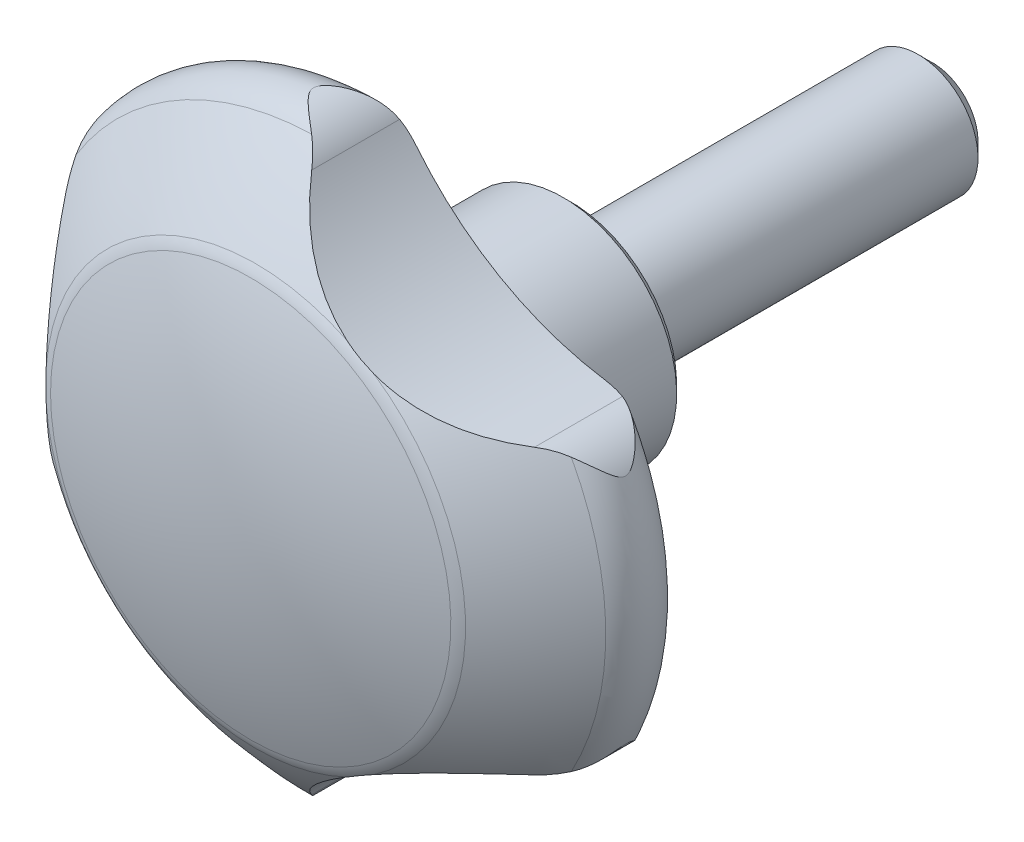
ISO-10303-21;
HEADER;
FILE_DESCRIPTION(('STEP AP214'),'2;1');
FILE_NAME('part.step','',(''),(''),'','','');
FILE_SCHEMA(('AUTOMOTIVE_DESIGN { 1 0 10303 214 1 1 1 1 }'));
ENDSEC;
DATA;
#1=APPLICATION_CONTEXT('core data for automotive mechanical design processes');
#2=APPLICATION_PROTOCOL_DEFINITION('international standard','automotive_design',2000,#1);
#3=PRODUCT_CONTEXT('',#1,'mechanical');
#4=PRODUCT('Part','Part','',(#3));
#5=PRODUCT_RELATED_PRODUCT_CATEGORY('part','',(#4));
#6=PRODUCT_DEFINITION_FORMATION('','',#4);
#7=PRODUCT_DEFINITION_CONTEXT('part definition',#1,'design');
#8=PRODUCT_DEFINITION('design','',#6,#7);
#9=PRODUCT_DEFINITION_SHAPE('','',#8);
#10=(LENGTH_UNIT() NAMED_UNIT(*) SI_UNIT(.MILLI.,.METRE.));
#11=(NAMED_UNIT(*) PLANE_ANGLE_UNIT() SI_UNIT($,.RADIAN.));
#12=(NAMED_UNIT(*) SI_UNIT($,.STERADIAN.) SOLID_ANGLE_UNIT());
#13=UNCERTAINTY_MEASURE_WITH_UNIT(LENGTH_MEASURE(1.E-05),#10,'distance_accuracy_value','');
#14=(GEOMETRIC_REPRESENTATION_CONTEXT(3) GLOBAL_UNCERTAINTY_ASSIGNED_CONTEXT((#13)) GLOBAL_UNIT_ASSIGNED_CONTEXT((#10,
#11,#12)) REPRESENTATION_CONTEXT('',''));
#15=CARTESIAN_POINT('',(0.,0.,0.));
#16=DIRECTION('',(0.,0.,1.));
#17=DIRECTION('',(1.,0.,0.));
#18=AXIS2_PLACEMENT_3D('',#15,#16,#17);
#19=CARTESIAN_POINT('',(0.,0.,18.75));
#20=DIRECTION('',(0.,0.,1.));
#21=DIRECTION('',(0.,-1.,0.));
#22=AXIS2_PLACEMENT_3D('',#19,#20,#21);
#23=TOROIDAL_SURFACE('',#22,21.25,3.75);
#24=CARTESIAN_POINT('',(0.,0.,15.));
#25=DIRECTION('',(0.,0.,1.));
#26=DIRECTION('',(0.,-1.,0.));
#27=AXIS2_PLACEMENT_3D('',#24,#25,#26);
#28=CIRCLE('',#27,21.25);
#29=CARTESIAN_POINT('',(-19.2095588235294,-9.0859974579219,15.));
#30=VERTEX_POINT('',#29);
#31=CARTESIAN_POINT('',(1.73607479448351,-21.1789646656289,15.));
#32=VERTEX_POINT('',#31);
#33=EDGE_CURVE('E339',#30,#32,#28,.T.);
#34=ORIENTED_EDGE('',*,*,#33,.T.);
#35=CARTESIAN_POINT('',(8.75,-15.1554445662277,18.75));
#36=CARTESIAN_POINT('',(8.74498488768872,-15.1583400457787,18.7465048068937));
#37=CARTESIAN_POINT('',(8.73997077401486,-15.1612372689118,18.7430096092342));
#38=CARTESIAN_POINT('',(8.4993134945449,-15.3004037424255,18.5752211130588));
#39=CARTESIAN_POINT('',(8.26586854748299,-15.440528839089,18.41093857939));
#40=CARTESIAN_POINT('',(7.80268506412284,-15.7289792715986,18.0843487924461));
#41=CARTESIAN_POINT('',(7.57294663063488,-15.8773048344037,17.9220415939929));
#42=CARTESIAN_POINT('',(7.11622865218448,-16.1829829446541,17.6011970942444));
#43=CARTESIAN_POINT('',(6.88925336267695,-16.3403476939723,17.4426653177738));
#44=CARTESIAN_POINT('',(6.43788004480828,-16.6646219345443,17.1318173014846));
#45=CARTESIAN_POINT('',(6.21348184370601,-16.8315307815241,16.9795006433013));
#46=CARTESIAN_POINT('',(5.76758448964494,-17.1751404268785,16.6840270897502));
#47=CARTESIAN_POINT('',(5.54607831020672,-17.3518078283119,16.5408421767));
#48=CARTESIAN_POINT('',(5.1049757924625,-17.7162904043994,16.2659140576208));
#49=CARTESIAN_POINT('',(4.88537987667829,-17.9041079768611,16.1341733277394));
#50=CARTESIAN_POINT('',(4.44877375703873,-18.2911215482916,15.8858938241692));
#51=CARTESIAN_POINT('',(4.23175823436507,-18.4902859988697,15.769315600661));
#52=CARTESIAN_POINT('',(3.8002030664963,-18.9009635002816,15.5550818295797));
#53=CARTESIAN_POINT('',(3.58566180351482,-19.1124678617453,15.4574131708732));
#54=CARTESIAN_POINT('',(3.2376169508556,-19.4685064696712,15.3172524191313));
#55=CARTESIAN_POINT('',(3.1031337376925,-19.6092876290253,15.2676363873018));
#56=CARTESIAN_POINT('',(2.83579563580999,-19.8958619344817,15.1795112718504));
#57=CARTESIAN_POINT('',(2.70294088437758,-20.0416554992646,15.1410031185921));
#58=CARTESIAN_POINT('',(2.43997889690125,-20.3372590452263,15.0769376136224));
#59=CARTESIAN_POINT('',(2.30986170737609,-20.4870470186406,15.0513204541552));
#60=CARTESIAN_POINT('',(2.05236733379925,-20.7907586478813,15.0146179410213));
#61=CARTESIAN_POINT('',(1.9249899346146,-20.9446819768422,15.0035314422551));
#62=CARTESIAN_POINT('',(1.69710201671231,-21.226904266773,14.9984199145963));
#63=CARTESIAN_POINT('',(1.59598831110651,-21.3546638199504,15.0016130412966));
#64=CARTESIAN_POINT('',(1.39673032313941,-21.6115378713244,15.0201012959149));
#65=CARTESIAN_POINT('',(1.29858441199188,-21.7406515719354,15.0353896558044));
#66=CARTESIAN_POINT('',(1.10471730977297,-22.0008735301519,15.0794596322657));
#67=CARTESIAN_POINT('',(1.00903821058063,-22.13198738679,15.1083978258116));
#68=CARTESIAN_POINT('',(0.821945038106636,-22.3935585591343,15.1809641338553));
#69=CARTESIAN_POINT('',(0.730539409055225,-22.5240141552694,15.2246200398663));
#70=CARTESIAN_POINT('',(0.64176588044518,-22.653317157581,15.2761534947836));
#71=B_SPLINE_CURVE_WITH_KNOTS('',3,(#35,#36,#37,#38,#39,#40,#41,#42,#43,#44,#45,#46,#47,#48,#49,
#50,#51,#52,#53,#54,#55,#56,#57,#58,#59,#60,#61,#62,#63,#64,#65,#66,#67,#68,#69,#70),
.UNSPECIFIED.,.F.,.F.,(4,2,2,2,2,2,2,2,2,2,2,2,2,2,2,2,2,4),(0.,0.0202919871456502,
0.974127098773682,1.92798862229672,2.88316947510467,3.83828592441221,4.79031492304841,
5.74254939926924,6.69225455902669,7.64129885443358,8.24373030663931,8.84621220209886,
9.44587249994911,10.0454855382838,10.5339430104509,11.0221273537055,11.5160531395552,
12.0109168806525),.UNSPECIFIED.);
#72=CARTESIAN_POINT('',(0.641903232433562,-22.653117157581,15.2760737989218));
#73=VERTEX_POINT('',#72);
#74=EDGE_CURVE('E244',#32,#73,#71,.T.);
#75=ORIENTED_EDGE('',*,*,#74,.T.);
#76=CARTESIAN_POINT('',(-0.666781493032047,-23.9562153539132,21.3362324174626));
#77=CARTESIAN_POINT('',(-0.779040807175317,-24.0326182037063,21.2527113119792));
#78=CARTESIAN_POINT('',(-0.89302919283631,-24.1034851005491,21.166546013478));
#79=CARTESIAN_POINT('',(-1.1233218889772,-24.2344319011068,20.9892190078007));
#80=CARTESIAN_POINT('',(-1.239626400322,-24.2945108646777,20.8980568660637));
#81=CARTESIAN_POINT('',(-1.47220267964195,-24.4035969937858,20.7119920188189));
#82=CARTESIAN_POINT('',(-1.5884627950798,-24.452710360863,20.6171366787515));
#83=CARTESIAN_POINT('',(-1.82073613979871,-24.540913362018,20.4226669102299));
#84=CARTESIAN_POINT('',(-1.93674944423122,-24.5800066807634,20.3230542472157));
#85=CARTESIAN_POINT('',(-2.13876860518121,-24.6402127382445,20.1429497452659));
#86=CARTESIAN_POINT('',(-2.22523948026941,-24.6633872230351,20.0636672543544));
#87=CARTESIAN_POINT('',(-2.39584370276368,-24.7044252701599,19.9005436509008));
#88=CARTESIAN_POINT('',(-2.47996510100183,-24.7222650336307,19.8166840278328));
#89=CARTESIAN_POINT('',(-2.64364796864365,-24.7528283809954,19.6421320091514));
#90=CARTESIAN_POINT('',(-2.72316471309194,-24.7655072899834,19.5513876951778));
#91=CARTESIAN_POINT('',(-2.83329888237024,-24.7807038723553,19.4080637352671));
#92=CARTESIAN_POINT('',(-2.86842549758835,-24.7851273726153,19.3591928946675));
#93=CARTESIAN_POINT('',(-2.93396075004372,-24.7927586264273,19.2583363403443));
#94=CARTESIAN_POINT('',(-2.96437822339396,-24.7959686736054,19.2063567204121));
#95=CARTESIAN_POINT('',(-3.0144821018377,-24.800888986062,19.1055183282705));
#96=CARTESIAN_POINT('',(-3.03504452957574,-24.8027388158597,19.0571145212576));
#97=CARTESIAN_POINT('',(-3.06800460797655,-24.8055734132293,18.9576248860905));
#98=CARTESIAN_POINT('',(-3.08043189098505,-24.8065613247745,18.9065495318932));
#99=CARTESIAN_POINT('',(-3.09365300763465,-24.8076017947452,18.8111290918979));
#100=CARTESIAN_POINT('',(-3.09598202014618,-24.8077780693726,18.7670046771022));
#101=CARTESIAN_POINT('',(-3.09282879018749,-24.8075341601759,18.6790329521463));
#102=CARTESIAN_POINT('',(-3.08734310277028,-24.8071137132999,18.6351857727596));
#103=CARTESIAN_POINT('',(-3.06687973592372,-24.8054649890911,18.5365627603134));
#104=CARTESIAN_POINT('',(-3.04962269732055,-24.8040388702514,18.4822778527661));
#105=CARTESIAN_POINT('',(-3.00692868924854,-24.8001673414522,18.3770209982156));
#106=CARTESIAN_POINT('',(-2.98145974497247,-24.7977179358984,18.3260629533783));
#107=CARTESIAN_POINT('',(-2.91562430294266,-24.790746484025,18.2104467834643));
#108=CARTESIAN_POINT('',(-2.87314027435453,-24.7858023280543,18.1470507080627));
#109=CARTESIAN_POINT('',(-2.78269141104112,-24.7739141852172,18.0244336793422));
#110=CARTESIAN_POINT('',(-2.73471407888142,-24.7669655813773,17.9652227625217));
#111=CARTESIAN_POINT('',(-2.63518542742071,-24.7509448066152,17.8495922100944));
#112=CARTESIAN_POINT('',(-2.58361436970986,-24.7418601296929,17.7931914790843));
#113=CARTESIAN_POINT('',(-2.47843898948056,-24.7215369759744,17.6828562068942));
#114=CARTESIAN_POINT('',(-2.42483664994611,-24.7103005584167,17.6289193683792));
#115=CARTESIAN_POINT('',(-2.24976068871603,-24.6704624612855,17.4578595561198));
#116=CARTESIAN_POINT('',(-2.1256921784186,-24.6374676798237,17.3443925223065));
#117=CARTESIAN_POINT('',(-1.87541516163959,-24.5599799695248,17.1237678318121));
#118=CARTESIAN_POINT('',(-1.74920468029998,-24.5154758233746,17.0166164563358));
#119=CARTESIAN_POINT('',(-1.49721992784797,-24.4147000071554,16.8080924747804));
#120=CARTESIAN_POINT('',(-1.37144532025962,-24.3584555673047,16.7067071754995));
#121=CARTESIAN_POINT('',(-1.12172304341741,-24.2337992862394,16.5094230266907));
#122=CARTESIAN_POINT('',(-0.997774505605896,-24.1653934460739,16.4135215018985));
#123=CARTESIAN_POINT('',(-0.771458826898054,-24.0273046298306,16.2415959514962));
#124=CARTESIAN_POINT('',(-0.668650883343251,-23.9593628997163,16.1647524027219));
#125=CARTESIAN_POINT('',(-0.466126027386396,-23.8142404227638,16.0157740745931));
#126=CARTESIAN_POINT('',(-0.366409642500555,-23.7370581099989,15.9436400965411));
#127=CARTESIAN_POINT('',(-0.171252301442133,-23.5735548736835,15.8049600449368));
#128=CARTESIAN_POINT('',(-0.0758000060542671,-23.4872605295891,15.7383986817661));
#129=CARTESIAN_POINT('',(0.110160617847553,-23.3052961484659,15.6114916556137));
#130=CARTESIAN_POINT('',(0.200670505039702,-23.2096290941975,15.5511440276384));
#131=CARTESIAN_POINT('',(0.350451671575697,-23.0379232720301,15.4540605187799));
#132=CARTESIAN_POINT('',(0.411203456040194,-22.9641817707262,15.4155347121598));
#133=CARTESIAN_POINT('',(0.52929297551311,-22.8120278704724,15.3425770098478));
#134=CARTESIAN_POINT('',(0.586629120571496,-22.733613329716,15.3081470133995));
#135=CARTESIAN_POINT('',(0.642040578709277,-22.652917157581,15.2759941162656));
#136=B_SPLINE_CURVE_WITH_KNOTS('',3,(#76,#77,#78,#79,#80,#81,#82,#83,#84,#85,#86,#87,#88,#89,
#90,#91,#92,#93,#94,#95,#96,#97,#98,#99,#100,#101,#102,#103,#104,#105,#106,#107,#108,#109,#110,
#111,#112,#113,#114,#115,#116,#117,#118,#119,#120,#121,#122,#123,#124,#125,#126,#127,#128,#129,
#130,#131,#132,#133,#134,#135),.UNSPECIFIED.,.F.,.F.,(4,2,2,2,2,2,2,2,2,2,2,2,2,2,2,2,2,2,2,2,2,
2,2,2,2,2,2,2,2,4),(0.,0.478066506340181,0.956174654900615,1.42942941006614,1.90250988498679,
2.26105820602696,2.6211829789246,2.98436206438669,3.16522841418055,3.34575116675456,
3.50311745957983,3.65990730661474,3.79177502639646,3.92370089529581,4.09363538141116,
4.26423970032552,4.49308748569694,4.72246665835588,4.95322376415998,5.18376112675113,
5.69710734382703,6.21095577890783,6.72362538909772,7.23604272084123,7.67134997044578,
8.10673109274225,8.5408755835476,8.97488235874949,9.28370938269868,9.59267905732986),.UNSPECIFIED.);
#137=CARTESIAN_POINT('',(-0.667050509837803,-23.9563984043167,21.3360324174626));
#138=VERTEX_POINT('',#137);
#139=EDGE_CURVE('E262',#138,#73,#136,.T.);
#140=ORIENTED_EDGE('',*,*,#139,.F.);
#141=CARTESIAN_POINT('',(0.,0.,21.3360324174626));
#142=DIRECTION('',(0.,0.,1.));
#143=DIRECTION('',(0.,-1.,0.));
#144=AXIS2_PLACEMENT_3D('',#141,#142,#143);
#145=CIRCLE('',#144,23.9656834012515);
#146=CARTESIAN_POINT('',(-20.4133243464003,-12.5558818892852,21.3360324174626));
#147=VERTEX_POINT('',#146);
#148=EDGE_CURVE('E352',#147,#138,#145,.T.);
#149=ORIENTED_EDGE('',*,*,#148,.F.);
#150=CARTESIAN_POINT('',(-19.939031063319,-10.7704540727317,15.2760010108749));
#151=CARTESIAN_POINT('',(-20.0050283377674,-10.9086558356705,15.3263308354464));
#152=CARTESIAN_POINT('',(-20.0638003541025,-11.0480982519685,15.3821742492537));
#153=CARTESIAN_POINT('',(-20.1673827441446,-11.3277657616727,15.5031978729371));
#154=CARTESIAN_POINT('',(-20.2122212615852,-11.4679886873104,15.5683588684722));
#155=CARTESIAN_POINT('',(-20.2885179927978,-11.7474655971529,15.7062356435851));
#156=CARTESIAN_POINT('',(-20.3200351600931,-11.8867211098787,15.7789163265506));
#157=CARTESIAN_POINT('',(-20.3707269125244,-12.1638995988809,15.9309548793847));
#158=CARTESIAN_POINT('',(-20.3898943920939,-12.3018217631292,16.0103165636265));
#159=CARTESIAN_POINT('',(-20.41824038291,-12.5919434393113,16.1847706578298));
#160=CARTESIAN_POINT('',(-20.4259231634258,-12.7438427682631,16.2806030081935));
#161=CARTESIAN_POINT('',(-20.427787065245,-13.043519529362,16.4786223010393));
#162=CARTESIAN_POINT('',(-20.4219661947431,-13.1912963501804,16.580810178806));
#163=CARTESIAN_POINT('',(-20.3980121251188,-13.4812904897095,16.7910102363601));
#164=CARTESIAN_POINT('',(-20.3798953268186,-13.6235149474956,16.8990144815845));
#165=CARTESIAN_POINT('',(-20.3327283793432,-13.9010593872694,17.1211871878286));
#166=CARTESIAN_POINT('',(-20.3036846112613,-14.0363833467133,17.2353520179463));
#167=CARTESIAN_POINT('',(-20.2487068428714,-14.2507406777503,17.4290773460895));
#168=CARTESIAN_POINT('',(-20.2254029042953,-14.3325341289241,17.5063383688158));
#169=CARTESIAN_POINT('',(-20.1759550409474,-14.4912780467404,17.6653563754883));
#170=CARTESIAN_POINT('',(-20.1498022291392,-14.5682121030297,17.7471270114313));
#171=CARTESIAN_POINT('',(-20.0959194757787,-14.715561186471,17.9178762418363));
#172=CARTESIAN_POINT('',(-20.0681749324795,-14.7858917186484,18.0069264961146));
#173=CARTESIAN_POINT('',(-20.0285289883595,-14.8809777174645,18.1478405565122));
#174=CARTESIAN_POINT('',(-20.0156706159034,-14.9108788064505,18.1959111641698));
#175=CARTESIAN_POINT('',(-19.9915548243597,-14.9656875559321,18.2951518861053));
#176=CARTESIAN_POINT('',(-19.9802939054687,-14.9906061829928,18.3463148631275));
#177=CARTESIAN_POINT('',(-19.9620564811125,-15.0303117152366,18.4451176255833));
#178=CARTESIAN_POINT('',(-19.9547077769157,-15.0460096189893,18.4923085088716));
#179=CARTESIAN_POINT('',(-19.9434458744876,-15.0698868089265,18.5888820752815));
#180=CARTESIAN_POINT('',(-19.9395203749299,-15.0780930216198,18.6382562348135));
#181=CARTESIAN_POINT('',(-19.9359663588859,-15.0855282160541,18.7383503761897));
#182=CARTESIAN_POINT('',(-19.9363784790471,-15.0846722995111,18.7890786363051));
#183=CARTESIAN_POINT('',(-19.9414927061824,-15.0739589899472,18.889382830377));
#184=CARTESIAN_POINT('',(-19.9462039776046,-15.064082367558,18.9389560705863));
#185=CARTESIAN_POINT('',(-19.9607791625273,-15.0330474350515,19.0502572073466));
#186=CARTESIAN_POINT('',(-19.971774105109,-15.0093721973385,19.1110985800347));
#187=CARTESIAN_POINT('',(-19.9967550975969,-14.9540281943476,19.2284300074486));
#188=CARTESIAN_POINT('',(-20.0107539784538,-14.9223250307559,19.2848999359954));
#189=CARTESIAN_POINT('',(-20.048100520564,-14.8348377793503,19.4245424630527));
#190=CARTESIAN_POINT('',(-20.0723291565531,-14.7754462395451,19.505166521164));
#191=CARTESIAN_POINT('',(-20.1205404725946,-14.6495558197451,19.6608254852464));
#192=CARTESIAN_POINT('',(-20.1445224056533,-14.583039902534,19.7358462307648));
#193=CARTESIAN_POINT('',(-20.1908743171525,-14.4447826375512,19.8823943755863));
#194=CARTESIAN_POINT('',(-20.2132328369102,-14.3730102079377,19.9538959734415));
#195=CARTESIAN_POINT('',(-20.2552915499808,-14.2259357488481,20.0938014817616));
#196=CARTESIAN_POINT('',(-20.2749943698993,-14.1506373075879,20.1622084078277));
#197=CARTESIAN_POINT('',(-20.3209136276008,-13.9561680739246,20.3324653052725));
#198=CARTESIAN_POINT('',(-20.34499093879,-13.8350387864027,20.4326698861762));
#199=CARTESIAN_POINT('',(-20.3844246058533,-13.5875110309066,20.6282828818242));
#200=CARTESIAN_POINT('',(-20.3997763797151,-13.4611098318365,20.723688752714));
#201=CARTESIAN_POINT('',(-20.4206049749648,-13.2065858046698,20.9080353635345));
#202=CARTESIAN_POINT('',(-20.4262663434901,-13.0785430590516,20.99706524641));
#203=CARTESIAN_POINT('',(-20.4275210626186,-12.8192577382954,21.1703181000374));
#204=CARTESIAN_POINT('',(-20.4231172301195,-12.6880160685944,21.2545424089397));
#205=CARTESIAN_POINT('',(-20.4133003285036,-12.5555573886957,21.3362324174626));
#206=B_SPLINE_CURVE_WITH_KNOTS('',3,(#150,#151,#152,#153,#154,#155,#156,#157,#158,#159,#160,
#161,#162,#163,#164,#165,#166,#167,#168,#169,#170,#171,#172,#173,#174,#175,#176,#177,#178,#179,
#180,#181,#182,#183,#184,#185,#186,#187,#188,#189,#190,#191,#192,#193,#194,#195,#196,#197,#198,
#199,#200,#201,#202,#203,#204,#205),.UNSPECIFIED.,.F.,.F.,(4,2,2,2,2,2,2,2,2,2,2,2,2,2,2,2,2,2,
2,2,2,2,2,2,2,2,2,4),(0.,0.483118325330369,0.965254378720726,1.44523381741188,1.92548917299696,
2.46406656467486,3.00272340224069,3.54066316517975,4.07828927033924,4.42280829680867,
4.76843461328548,5.11800857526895,5.29196411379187,5.46553245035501,5.61580302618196,
5.76553135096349,5.91666363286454,6.06811883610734,6.26561792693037,6.46397802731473,
6.77228653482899,7.08134952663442,7.39241624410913,7.70317300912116,8.17985294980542,
8.65678297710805,9.12452475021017,9.59213563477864),.UNSPECIFIED.);
#207=CARTESIAN_POINT('',(-19.9391265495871,-10.7706540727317,15.2760737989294));
#208=VERTEX_POINT('',#207);
#209=EDGE_CURVE('E194',#208,#147,#206,.T.);
#210=ORIENTED_EDGE('',*,*,#209,.F.);
#211=CARTESIAN_POINT('',(-17.5,0.,18.75));
#212=CARTESIAN_POINT('',(-17.5000000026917,-0.00579095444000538,18.7465048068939));
#213=CARTESIAN_POINT('',(-17.5000020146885,-0.0115819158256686,18.7430096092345));
#214=CARTESIAN_POINT('',(-17.5001950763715,-0.289580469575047,18.5752211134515));
#215=CARTESIAN_POINT('',(-17.5048244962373,-0.561812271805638,18.4109385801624));
#216=CARTESIAN_POINT('',(-17.5230381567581,-1.10716614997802,18.0843487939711));
#217=CARTESIAN_POINT('',(-17.5366226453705,-1.38028825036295,17.9220415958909));
#218=CARTESIAN_POINT('',(-17.5729886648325,-1.92865667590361,17.6011970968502));
#219=CARTESIAN_POINT('',(-17.5957828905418,-2.20390541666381,17.4426653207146));
#220=CARTESIAN_POINT('',(-17.6509259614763,-2.75694329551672,17.1318173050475));
#221=CARTESIAN_POINT('',(-17.6832741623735,-3.03473226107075,16.9795006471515));
#222=CARTESIAN_POINT('',(-17.7579001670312,-3.59269551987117,16.6840270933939));
#223=CARTESIAN_POINT('',(-17.8001455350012,-3.87285919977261,16.540842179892));
#224=CARTESIAN_POINT('',(-17.8952454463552,-4.43710647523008,16.2659140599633));
#225=CARTESIAN_POINT('',(-17.9481022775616,-4.72119090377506,16.1341733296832));
#226=CARTESIAN_POINT('',(-18.0649628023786,-5.29280968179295,15.885893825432));
#227=CARTESIAN_POINT('',(-18.1289365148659,-5.58033286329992,15.7693156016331));
#228=CARTESIAN_POINT('',(-18.2688160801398,-6.15940935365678,15.5550818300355));
#229=CARTESIAN_POINT('',(-18.3447135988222,-6.45095971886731,15.45741317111));
#230=CARTESIAN_POINT('',(-18.4790297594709,-6.93039509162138,15.3172523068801));
#231=CARTESIAN_POINT('',(-18.5337083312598,-7.11725193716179,15.2676361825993));
#232=CARTESIAN_POINT('',(-18.6482201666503,-7.49206145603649,15.1795109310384));
#233=CARTESIAN_POINT('',(-18.7080538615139,-7.68001421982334,15.1410027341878));
#234=CARTESIAN_POINT('',(-18.8325733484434,-8.05554853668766,15.0769372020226));
#235=CARTESIAN_POINT('',(-18.8972351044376,-8.24312770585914,15.051320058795));
#236=CARTESIAN_POINT('',(-19.0315102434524,-8.61798096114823,15.0146176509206));
#237=CARTESIAN_POINT('',(-19.101123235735,-8.80525507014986,15.0035312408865));
#238=CARTESIAN_POINT('',(-19.2315903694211,-9.14372123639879,14.9984199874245));
#239=CARTESIAN_POINT('',(-19.2916757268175,-9.29516598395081,15.0016131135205));
#240=CARTESIAN_POINT('',(-19.4145044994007,-9.59616141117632,15.0201010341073));
#241=CARTESIAN_POINT('',(-19.4772464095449,-9.74571310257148,15.0353890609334));
#242=CARTESIAN_POINT('',(-19.6056698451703,-10.0437139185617,15.0794579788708));
#243=CARTESIAN_POINT('',(-19.6713772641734,-10.192129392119,15.1083954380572));
#244=CARTESIAN_POINT('',(-19.8043560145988,-10.4849385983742,15.180959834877));
#245=CARTESIAN_POINT('',(-19.8716300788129,-10.6293241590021,15.2246145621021));
#246=CARTESIAN_POINT('',(-19.9392220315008,-10.7708540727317,15.2761465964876));
#247=B_SPLINE_CURVE_WITH_KNOTS('',3,(#211,#212,#213,#214,#215,#216,#217,#218,#219,#220,#221,
#222,#223,#224,#225,#226,#227,#228,#229,#230,#231,#232,#233,#234,#235,#236,#237,#238,#239,#240,
#241,#242,#243,#244,#245,#246),.UNSPECIFIED.,.F.,.F.,(4,2,2,2,2,2,2,2,2,2,2,2,2,2,2,2,2,4),(0.,
0.0202919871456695,0.974127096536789,1.92798861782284,2.88316946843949,3.83828591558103,
4.79031491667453,5.74254939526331,6.69225455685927,7.64129885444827,8.24373154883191,
8.84621468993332,9.44587623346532,10.0454905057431,10.5339413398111,11.0221190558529,
11.5160379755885,12.0108948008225),.UNSPECIFIED.);
#248=EDGE_CURVE('E133',#208,#30,#247,.F.);
#249=ORIENTED_EDGE('',*,*,#248,.T.);
#250=EDGE_LOOP('',(#34,#75,#140,#149,#210,#249));
#251=FACE_BOUND('',#250,.T.);
#252=ADVANCED_FACE('F14',(#251),#23,.T.);
#253=CARTESIAN_POINT('',(0.64204057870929,22.652917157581,15.2759941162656));
#254=CARTESIAN_POINT('',(0.555353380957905,22.7791739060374,15.3263234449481));
#255=CARTESIAN_POINT('',(0.463979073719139,22.8997937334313,15.3821664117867));
#256=CARTESIAN_POINT('',(0.273571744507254,23.1293335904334,15.5031892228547));
#257=CARTESIAN_POINT('',(0.174554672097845,23.2382769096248,15.5683498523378));
#258=CARTESIAN_POINT('',(-0.0293305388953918,23.4440913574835,15.7062259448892));
#259=CARTESIAN_POINT('',(-0.134170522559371,23.5410143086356,15.7789063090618));
#260=CARTESIAN_POINT('',(-0.348867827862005,23.7235049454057,15.9309442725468));
#261=CARTESIAN_POINT('',(-0.458727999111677,23.8090660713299,16.0103056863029));
#262=CARTESIAN_POINT('',(-0.695807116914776,23.9786761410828,16.1847590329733));
#263=CARTESIAN_POINT('',(-0.823513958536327,24.0612796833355,16.2805908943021));
#264=CARTESIAN_POINT('',(-1.08210885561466,24.2127330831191,16.478609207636));
#265=CARTESIAN_POINT('',(-1.21299737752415,24.2815809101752,16.5807965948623));
#266=CARTESIAN_POINT('',(-1.47611600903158,24.4058340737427,16.7909956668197));
#267=CARTESIAN_POINT('',(-1.60834410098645,24.4612571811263,16.8989994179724));
#268=CARTESIAN_POINT('',(-1.8722876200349,24.5591826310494,17.1211710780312));
#269=CARTESIAN_POINT('',(-2.00400330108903,24.6016924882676,17.2353353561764));
#270=CARTESIAN_POINT('',(-2.21713195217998,24.6612601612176,17.429060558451));
#271=CARTESIAN_POINT('',(-2.2996201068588,24.6819756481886,17.5063220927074));
#272=CARTESIAN_POINT('',(-2.4618223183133,24.7185255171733,17.6653410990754));
#273=CARTESIAN_POINT('',(-2.5415266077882,24.7343439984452,17.747112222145));
#274=CARTESIAN_POINT('',(-2.69607819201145,24.7613555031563,17.9178623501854));
#275=CARTESIAN_POINT('',(-2.77085961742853,24.7724936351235,18.0069130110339));
#276=CARTESIAN_POINT('',(-2.87303137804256,24.7857026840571,18.1478276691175));
#277=CARTESIAN_POINT('',(-2.90535633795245,24.789517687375,18.1958984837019));
#278=CARTESIAN_POINT('',(-2.96488143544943,24.7960374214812,18.2951396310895));
#279=CARTESIAN_POINT('',(-2.99209281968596,24.7987446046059,18.3463028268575));
#280=CARTESIAN_POINT('',(-3.03559903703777,24.8028034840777,18.445106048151));
#281=CARTESIAN_POINT('',(-3.05286890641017,24.8042883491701,18.4922971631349));
#282=CARTESIAN_POINT('',(-3.07917959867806,24.8064739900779,18.5888712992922));
#283=CARTESIAN_POINT('',(-3.08824989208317,24.8071775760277,18.6382457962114));
#284=CARTESIAN_POINT('',(-3.09646736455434,24.8078174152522,18.7383408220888));
#285=CARTESIAN_POINT('',(-3.09552068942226,24.8077464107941,18.7890696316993));
#286=CARTESIAN_POINT('',(-3.08368654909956,24.8068188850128,18.8893749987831));
#287=CARTESIAN_POINT('',(-3.07277784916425,24.8059606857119,18.938948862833));
#288=CARTESIAN_POINT('',(-3.03861415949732,24.8030657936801,19.0502498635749));
#289=CARTESIAN_POINT('',(-3.01261416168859,24.8007501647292,19.1110905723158));
#290=CARTESIAN_POINT('',(-2.95219604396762,24.7947125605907,19.2284207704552));
#291=CARTESIAN_POINT('',(-2.91774171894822,24.7909844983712,19.2848901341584));
#292=CARTESIAN_POINT('',(-2.82330501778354,24.7795843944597,19.4245304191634));
#293=CARTESIAN_POINT('',(-2.75975811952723,24.7708716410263,19.5051529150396));
#294=CARTESIAN_POINT('',(-2.62663219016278,24.7496796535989,19.66080887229));
#295=CARTESIAN_POINT('',(-2.5570387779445,24.7371912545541,19.7358281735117));
#296=CARTESIAN_POINT('',(-2.41413255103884,24.7082059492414,19.8823735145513));
#297=CARTESIAN_POINT('',(-2.34079854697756,24.6916835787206,19.9538737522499));
#298=CARTESIAN_POINT('',(-2.19240293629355,24.6545720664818,20.0937766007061));
#299=CARTESIAN_POINT('',(-2.11734312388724,24.6339869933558,20.1621822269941));
#300=CARTESIAN_POINT('',(-1.92596765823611,24.5765208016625,20.332440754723));
#301=CARTESIAN_POINT('',(-1.80902532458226,24.5368075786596,20.4326480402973));
#302=CARTESIAN_POINT('',(-1.57493778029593,24.4471935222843,20.6282662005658));
#303=CARTESIAN_POINT('',(-1.45779249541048,24.397287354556,20.7236745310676));
#304=CARTESIAN_POINT('',(-1.22694864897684,24.2880618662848,20.908025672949));
#305=CARTESIAN_POINT('',(-1.11322716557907,24.2289424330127,20.9970576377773));
#306=CARTESIAN_POINT('',(-0.888047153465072,24.1003840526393,21.1703144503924));
#307=CARTESIAN_POINT('',(-0.776588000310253,24.0309479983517,21.2545406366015));
#308=CARTESIAN_POINT('',(-0.666781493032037,23.9562153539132,21.3362324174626));
#309=B_SPLINE_CURVE_WITH_KNOTS('',3,(#253,#254,#255,#256,#257,#258,#259,#260,#261,#262,#263,
#264,#265,#266,#267,#268,#269,#270,#271,#272,#273,#274,#275,#276,#277,#278,#279,#280,#281,#282,
#283,#284,#285,#286,#287,#288,#289,#290,#291,#292,#293,#294,#295,#296,#297,#298,#299,#300,#301,
#302,#303,#304,#305,#306,#307,#308),.UNSPECIFIED.,.F.,.F.,(4,2,2,2,2,2,2,2,2,2,2,2,2,2,2,2,2,2,
2,2,2,2,2,2,2,2,2,4),(0.,0.48311849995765,0.965254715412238,1.44523419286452,1.92548959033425,
2.46406579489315,3.00272143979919,3.54066009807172,4.07828510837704,4.42280757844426,
4.76843726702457,5.11801444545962,5.29197165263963,5.46554166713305,5.61581366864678,
5.7655433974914,5.91667725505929,6.06813401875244,6.26563030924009,6.46398759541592,
6.7722886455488,7.08134416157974,7.39240344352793,7.70315278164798,8.17984372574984,
8.65678478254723,9.12453669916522,9.59215770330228),.UNSPECIFIED.);
#310=CARTESIAN_POINT('',(0.641903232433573,22.653117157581,15.2760737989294));
#311=VERTEX_POINT('',#310);
#312=CARTESIAN_POINT('',(-0.667050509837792,23.9563984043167,21.3360324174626));
#313=VERTEX_POINT('',#312);
#314=EDGE_CURVE('E282',#311,#313,#309,.T.);
#315=ORIENTED_EDGE('',*,*,#314,.F.);
#316=CARTESIAN_POINT('',(8.75,15.1554445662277,18.75));
#317=CARTESIAN_POINT('',(8.74498488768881,15.1583400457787,18.7465048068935));
#318=CARTESIAN_POINT('',(8.73997077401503,15.1612372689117,18.7430096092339));
#319=CARTESIAN_POINT('',(8.49931349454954,15.3004037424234,18.5752211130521));
#320=CARTESIAN_POINT('',(8.2658685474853,15.4405288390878,18.410938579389));
#321=CARTESIAN_POINT('',(7.80268506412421,15.7289792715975,18.0843487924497));
#322=CARTESIAN_POINT('',(7.57294663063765,15.8773048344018,17.9220415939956));
#323=CARTESIAN_POINT('',(7.11622865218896,16.1829829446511,17.6011970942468));
#324=CARTESIAN_POINT('',(6.88925336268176,16.3403476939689,17.442665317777));
#325=CARTESIAN_POINT('',(6.43788004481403,16.66462193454,17.1318173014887));
#326=CARTESIAN_POINT('',(6.21348184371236,16.8315307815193,16.9795006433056));
#327=CARTESIAN_POINT('',(5.76758448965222,17.1751404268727,16.684027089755));
#328=CARTESIAN_POINT('',(5.54607831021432,17.3518078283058,16.5408421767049));
#329=CARTESIAN_POINT('',(5.10497579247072,17.7162904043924,16.2659140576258));
#330=CARTESIAN_POINT('',(4.88537987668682,17.9041079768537,16.1341733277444));
#331=CARTESIAN_POINT('',(4.44877375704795,18.2911215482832,15.8858938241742));
#332=CARTESIAN_POINT('',(4.23175823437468,18.4902859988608,15.7693156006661));
#333=CARTESIAN_POINT('',(3.80020306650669,18.9009635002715,15.5550818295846));
#334=CARTESIAN_POINT('',(3.58566180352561,19.1124678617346,15.4574131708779));
#335=CARTESIAN_POINT('',(3.23761695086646,19.46850646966,15.3172524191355));
#336=CARTESIAN_POINT('',(3.10313373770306,19.6092876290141,15.2676363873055));
#337=CARTESIAN_POINT('',(2.83579563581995,19.8958619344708,15.1795112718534));
#338=CARTESIAN_POINT('',(2.70294088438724,20.0416554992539,15.1410031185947));
#339=CARTESIAN_POINT('',(2.43997889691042,20.3372590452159,15.0769376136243));
#340=CARTESIAN_POINT('',(2.30986170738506,20.4870470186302,15.0513204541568));
#341=CARTESIAN_POINT('',(2.05236733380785,20.790758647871,15.0146179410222));
#342=CARTESIAN_POINT('',(1.92498993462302,20.944681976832,15.0035314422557));
#343=CARTESIAN_POINT('',(1.69710201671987,21.2269042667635,14.9984199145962));
#344=CARTESIAN_POINT('',(1.5959883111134,21.3546638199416,15.0016130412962));
#345=CARTESIAN_POINT('',(1.39673032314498,21.6115378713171,15.0201012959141));
#346=CARTESIAN_POINT('',(1.29858441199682,21.7406515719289,15.0353896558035));
#347=CARTESIAN_POINT('',(1.10471730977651,22.0008735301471,15.0794596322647));
#348=CARTESIAN_POINT('',(1.00903821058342,22.1319873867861,15.1083978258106));
#349=CARTESIAN_POINT('',(0.821945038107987,22.3935585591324,15.1809641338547));
#350=CARTESIAN_POINT('',(0.730539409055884,22.5240141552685,15.2246200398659));
#351=CARTESIAN_POINT('',(0.641765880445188,22.653317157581,15.2761534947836));
#352=B_SPLINE_CURVE_WITH_KNOTS('',3,(#316,#317,#318,#319,#320,#321,#322,#323,#324,#325,#326,
#327,#328,#329,#330,#331,#332,#333,#334,#335,#336,#337,#338,#339,#340,#341,#342,#343,#344,#345,
#346,#347,#348,#349,#350,#351),.UNSPECIFIED.,.F.,.F.,(4,2,2,2,2,2,2,2,2,2,2,2,2,2,2,2,2,4),(0.,
0.0202919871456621,0.974127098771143,1.92798862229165,2.88316947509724,3.83828592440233,
4.79031492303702,5.74254939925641,6.69225455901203,7.64129885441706,8.24373030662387,
8.8462122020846,9.44587249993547,10.0454855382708,10.5339430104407,11.0221273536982,
11.5160531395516,12.0109168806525),.UNSPECIFIED.);
#353=CARTESIAN_POINT('',(1.73607479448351,21.1789646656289,15.));
#354=VERTEX_POINT('',#353);
#355=EDGE_CURVE('E252',#311,#354,#352,.F.);
#356=ORIENTED_EDGE('',*,*,#355,.T.);
#357=CARTESIAN_POINT('',(-19.2095588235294,9.08599745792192,15.));
#358=VERTEX_POINT('',#357);
#359=EDGE_CURVE('E345',#354,#358,#28,.T.);
#360=ORIENTED_EDGE('',*,*,#359,.T.);
#361=CARTESIAN_POINT('',(-17.5,0.,18.75));
#362=CARTESIAN_POINT('',(-17.5000000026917,0.00579095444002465,18.7465048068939));
#363=CARTESIAN_POINT('',(-17.5000020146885,0.0115819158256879,18.7430096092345));
#364=CARTESIAN_POINT('',(-17.5001950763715,0.289580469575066,18.5752211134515));
#365=CARTESIAN_POINT('',(-17.5048244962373,0.561812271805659,18.4109385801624));
#366=CARTESIAN_POINT('',(-17.5230381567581,1.10716614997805,18.0843487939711));
#367=CARTESIAN_POINT('',(-17.5366226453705,1.38028825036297,17.9220415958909));
#368=CARTESIAN_POINT('',(-17.5729886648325,1.92865667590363,17.6011970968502));
#369=CARTESIAN_POINT('',(-17.5957828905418,2.20390541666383,17.4426653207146));
#370=CARTESIAN_POINT('',(-17.6509259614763,2.75694329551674,17.1318173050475));
#371=CARTESIAN_POINT('',(-17.6832741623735,3.03473226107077,16.9795006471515));
#372=CARTESIAN_POINT('',(-17.7579001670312,3.59269551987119,16.6840270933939));
#373=CARTESIAN_POINT('',(-17.8001455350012,3.87285919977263,16.540842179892));
#374=CARTESIAN_POINT('',(-17.8952454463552,4.43710647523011,16.2659140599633));
#375=CARTESIAN_POINT('',(-17.9481022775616,4.72119090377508,16.1341733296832));
#376=CARTESIAN_POINT('',(-18.0649628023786,5.29280968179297,15.885893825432));
#377=CARTESIAN_POINT('',(-18.1289365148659,5.58033286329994,15.7693156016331));
#378=CARTESIAN_POINT('',(-18.2688160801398,6.1594093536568,15.5550818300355));
#379=CARTESIAN_POINT('',(-18.3447135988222,6.45095971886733,15.45741317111));
#380=CARTESIAN_POINT('',(-18.4790297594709,6.9303950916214,15.3172523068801));
#381=CARTESIAN_POINT('',(-18.5337083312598,7.11725193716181,15.2676361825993));
#382=CARTESIAN_POINT('',(-18.6482201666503,7.49206145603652,15.1795109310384));
#383=CARTESIAN_POINT('',(-18.7080538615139,7.68001421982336,15.1410027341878));
#384=CARTESIAN_POINT('',(-18.8325733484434,8.05554853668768,15.0769372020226));
#385=CARTESIAN_POINT('',(-18.8972351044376,8.24312770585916,15.051320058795));
#386=CARTESIAN_POINT('',(-19.0315102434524,8.61798096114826,15.0146176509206));
#387=CARTESIAN_POINT('',(-19.101123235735,8.80525507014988,15.0035312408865));
#388=CARTESIAN_POINT('',(-19.2315903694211,9.14372123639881,14.9984199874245));
#389=CARTESIAN_POINT('',(-19.2916757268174,9.29516598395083,15.0016131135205));
#390=CARTESIAN_POINT('',(-19.4145044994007,9.59616141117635,15.0201010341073));
#391=CARTESIAN_POINT('',(-19.4772464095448,9.74571310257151,15.0353890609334));
#392=CARTESIAN_POINT('',(-19.6056698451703,10.0437139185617,15.0794579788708));
#393=CARTESIAN_POINT('',(-19.6713772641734,10.192129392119,15.1083954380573));
#394=CARTESIAN_POINT('',(-19.8043560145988,10.4849385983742,15.180959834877));
#395=CARTESIAN_POINT('',(-19.8716300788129,10.6293241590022,15.2246145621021));
#396=CARTESIAN_POINT('',(-19.9392220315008,10.7708540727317,15.2761465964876));
#397=B_SPLINE_CURVE_WITH_KNOTS('',3,(#361,#362,#363,#364,#365,#366,#367,#368,#369,#370,#371,
#372,#373,#374,#375,#376,#377,#378,#379,#380,#381,#382,#383,#384,#385,#386,#387,#388,#389,#390,
#391,#392,#393,#394,#395,#396),.UNSPECIFIED.,.F.,.F.,(4,2,2,2,2,2,2,2,2,2,2,2,2,2,2,2,2,4),(0.,
0.0202919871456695,0.974127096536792,1.92798861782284,2.88316946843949,3.83828591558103,
4.79031491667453,5.74254939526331,6.69225455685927,7.64129885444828,8.24373154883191,
8.84621468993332,9.44587623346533,10.0454905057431,10.5339413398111,11.0221190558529,
11.5160379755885,12.0108948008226),.UNSPECIFIED.);
#398=CARTESIAN_POINT('',(-19.9391265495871,10.7706540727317,15.2760737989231));
#399=VERTEX_POINT('',#398);
#400=EDGE_CURVE('E226',#358,#399,#397,.T.);
#401=ORIENTED_EDGE('',*,*,#400,.T.);
#402=CARTESIAN_POINT('',(-20.4133003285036,12.5555573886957,21.3362324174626));
#403=CARTESIAN_POINT('',(-20.4233374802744,12.6909782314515,21.2527113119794));
#404=CARTESIAN_POINT('',(-20.4277158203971,12.8251285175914,21.1665460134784));
#405=CARTESIAN_POINT('',(-20.425972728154,13.0900412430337,20.9892190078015));
#406=CARTESIAN_POINT('',(-20.419850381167,13.2208033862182,20.8980568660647));
#407=CARTESIAN_POINT('',(-20.3980336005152,13.476763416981,20.71199201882));
#408=CARTESIAN_POINT('',(-20.3824369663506,13.602004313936,20.6171366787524));
#409=CARTESIAN_POINT('',(-20.3426863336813,13.8472604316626,20.4226669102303));
#410=CARTESIAN_POINT('',(-20.3185354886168,13.9672775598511,20.3230542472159));
#411=CARTESIAN_POINT('',(-20.269665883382,14.1723343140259,20.1429497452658));
#412=CARTESIAN_POINT('',(-20.2465001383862,14.2588075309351,20.0636672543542));
#413=CARTESIAN_POINT('',(-20.1967380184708,14.4270741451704,19.9005436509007));
#414=CARTESIAN_POINT('',(-20.170127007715,14.5088452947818,19.8166840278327));
#415=CARTESIAN_POINT('',(-20.1147542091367,14.6658804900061,19.6421320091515));
#416=CARTESIAN_POINT('',(-20.0859760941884,14.7410834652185,19.5513876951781));
#417=CARTESIAN_POINT('',(-20.0440696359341,14.8440607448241,19.4080637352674));
#418=CARTESIAN_POINT('',(-20.0303371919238,14.876693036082,19.3591928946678));
#419=CARTESIAN_POINT('',(-20.00417842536,14.9372638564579,19.2583363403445));
#420=CARTESIAN_POINT('',(-19.9917496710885,14.9652111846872,19.2063567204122));
#421=CARTESIAN_POINT('',(-19.9709588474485,15.011062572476,19.1055183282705));
#422=CARTESIAN_POINT('',(-19.962279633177,15.0297950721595,19.0571145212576));
#423=CARTESIAN_POINT('',(-19.9482544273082,15.0597566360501,18.9576248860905));
#424=CARTESIAN_POINT('',(-19.9428963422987,15.071012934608,18.9065495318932));
#425=CARTESIAN_POINT('',(-19.9371868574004,15.0829829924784,18.8111290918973));
#426=CARTESIAN_POINT('',(-19.93617500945,15.0850881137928,18.7670046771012));
#427=CARTESIAN_POINT('',(-19.9375403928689,15.0822353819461,18.6790329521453));
#428=CARTESIAN_POINT('',(-19.9399191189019,15.0772744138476,18.6351857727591));
#429=CARTESIAN_POINT('',(-19.9487229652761,15.0587282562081,18.5365627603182));
#430=CARTESIAN_POINT('',(-19.9561164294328,15.0430701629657,18.4822778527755));
#431=CARTESIAN_POINT('',(-19.9741105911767,15.0041603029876,18.3770209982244));
#432=CARTESIAN_POINT('',(-19.9847238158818,14.9808788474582,18.3260629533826));
#433=CARTESIAN_POINT('',(-20.0116040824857,14.9203779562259,18.2104467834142));
#434=CARTESIAN_POINT('',(-20.0285643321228,14.8811136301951,18.1470507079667));
#435=CARTESIAN_POINT('',(-20.0634933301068,14.7968385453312,18.0244336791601));
#436=CARTESIAN_POINT('',(-20.0814643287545,14.7518146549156,17.9652227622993));
#437=CARTESIAN_POINT('',(-20.1173542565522,14.6576099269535,17.8495922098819));
#438=CARTESIAN_POINT('',(-20.1352722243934,14.6084057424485,17.7931914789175));
#439=CARTESIAN_POINT('',(-20.1702595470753,14.5071596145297,17.6828562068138));
#440=CARTESIAN_POINT('',(-20.1873296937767,14.4551204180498,17.6289193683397));
#441=CARTESIAN_POINT('',(-20.240366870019,14.2835811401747,17.4578595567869));
#442=CARTESIAN_POINT('',(-20.2738268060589,14.1596372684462,17.3443925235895));
#443=CARTESIAN_POINT('',(-20.3318589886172,13.9041471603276,17.1237678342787));
#444=CARTESIAN_POINT('',(-20.3564225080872,13.7725936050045,17.0166164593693));
#445=CARTESIAN_POINT('',(-20.3951404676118,13.5039805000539,16.8080924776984));
#446=CARTESIAN_POINT('',(-20.4093186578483,13.3669342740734,16.7067071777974));
#447=CARTESIAN_POINT('',(-20.426224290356,13.0883402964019,16.5094230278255));
#448=CARTESIAN_POINT('',(-20.4289573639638,12.9467947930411,16.4135215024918));
#449=CARTESIAN_POINT('',(-20.4225267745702,12.6817550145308,16.2415957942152));
#450=CARTESIAN_POINT('',(-20.4150914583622,12.5587496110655,16.16475209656));
#451=CARTESIAN_POINT('',(-20.3906740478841,12.3107962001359,16.0157734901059));
#452=CARTESIAN_POINT('',(-20.3736903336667,12.1858478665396,15.9436393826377));
#453=CARTESIAN_POINT('',(-20.3296708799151,11.9350845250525,15.8049590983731));
#454=CARTESIAN_POINT('',(-20.3026638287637,11.8092729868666,15.7383976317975));
#455=CARTESIAN_POINT('',(-20.2380581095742,11.5572436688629,15.6114904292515));
#456=CARTESIAN_POINT('',(-20.2004628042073,11.4310260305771,15.5511427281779));
#457=CARTESIAN_POINT('',(-20.126652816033,11.2154622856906,15.4540608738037));
#458=CARTESIAN_POINT('',(-20.0931681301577,11.1259826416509,15.4155366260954));
#459=CARTESIAN_POINT('',(-20.0204470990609,10.9476445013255,15.342581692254));
#460=CARTESIAN_POINT('',(-19.9812081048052,10.8587863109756,15.3081529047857));
#461=CARTESIAN_POINT('',(-19.939031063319,10.7704540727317,15.2760010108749));
#462=B_SPLINE_CURVE_WITH_KNOTS('',3,(#402,#403,#404,#405,#406,#407,#408,#409,#410,#411,#412,
#413,#414,#415,#416,#417,#418,#419,#420,#421,#422,#423,#424,#425,#426,#427,#428,#429,#430,#431,
#432,#433,#434,#435,#436,#437,#438,#439,#440,#441,#442,#443,#444,#445,#446,#447,#448,#449,#450,
#451,#452,#453,#454,#455,#456,#457,#458,#459,#460,#461),.UNSPECIFIED.,.F.,.F.,(4,2,2,2,2,2,2,2,
2,2,2,2,2,2,2,2,2,2,2,2,2,2,2,2,2,2,2,2,2,4),(0.,0.478066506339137,0.956174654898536,
1.42942941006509,1.90250988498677,2.26105820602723,2.62118297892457,2.98436206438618,
3.16522841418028,3.34575116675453,3.50311745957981,3.65990730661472,3.79177502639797,
3.92370089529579,4.0936353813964,4.26423970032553,4.49308748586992,4.72246665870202,
4.95322376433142,5.18376112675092,5.69710734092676,6.21095577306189,6.72362538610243,
7.23604272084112,7.6713508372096,8.10673282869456,8.54087817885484,8.97488580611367,
9.28370008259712,9.59265697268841),.UNSPECIFIED.);
#463=CARTESIAN_POINT('',(-20.4133243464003,12.5558818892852,21.3360324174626));
#464=VERTEX_POINT('',#463);
#465=EDGE_CURVE('E139',#464,#399,#462,.T.);
#466=ORIENTED_EDGE('',*,*,#465,.F.);
#467=EDGE_CURVE('E146',#313,#464,#145,.T.);
#468=ORIENTED_EDGE('',*,*,#467,.F.);
#469=EDGE_LOOP('',(#315,#356,#360,#401,#466,#468));
#470=FACE_BOUND('',#469,.T.);
#471=ADVANCED_FACE('F212',(#470),#23,.T.);
#472=CARTESIAN_POINT('',(0.,0.,-4.524291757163));
#473=DIRECTION('',(0.,0.,1.));
#474=DIRECTION('',(0.,-1.,0.));
#475=AXIS2_PLACEMENT_3D('',#472,#473,#474);
#476=DEGENERATE_TOROIDAL_SURFACE('',#475,3.19115061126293,37.5,.F.);
#477=CARTESIAN_POINT('',(0.642040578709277,-22.652917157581,22.639358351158));
#478=CARTESIAN_POINT('',(0.556852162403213,-22.7769460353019,22.5236608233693));
#479=CARTESIAN_POINT('',(0.465592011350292,-22.8978692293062,22.4090241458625));
#480=CARTESIAN_POINT('',(0.271527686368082,-23.1317778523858,22.1835052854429));
#481=CARTESIAN_POINT('',(0.168801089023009,-23.2448091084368,22.072603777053));
#482=CARTESIAN_POINT('',(-0.0487066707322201,-23.4628390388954,21.8546645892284));
#483=CARTESIAN_POINT('',(-0.163490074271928,-23.5678362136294,21.7476276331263));
#484=CARTESIAN_POINT('',(-0.40587186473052,-23.7692220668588,21.5379319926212));
#485=CARTESIAN_POINT('',(-0.533548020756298,-23.8655509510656,21.4353059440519));
#486=CARTESIAN_POINT('',(-0.667319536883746,-23.9565814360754,21.3358324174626));
#487=B_SPLINE_CURVE_WITH_KNOTS('',3,(#477,#478,#479,#480,#481,#482,#483,#484,#485,#486),
.UNSPECIFIED.,.F.,.F.,(4,2,2,2,4),(0.,0.569360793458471,1.13507961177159,1.70090377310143,
2.27037189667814),.UNSPECIFIED.);
#488=CARTESIAN_POINT('',(0.641903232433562,-22.653117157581,22.6391717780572));
#489=VERTEX_POINT('',#488);
#490=EDGE_CURVE('E150',#489,#138,#487,.T.);
#491=ORIENTED_EDGE('',*,*,#490,.F.);
#492=CARTESIAN_POINT('',(0.641765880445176,-22.653317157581,22.638985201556));
#493=CARTESIAN_POINT('',(0.897236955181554,-22.2812701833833,22.9860921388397));
#494=CARTESIAN_POINT('',(1.16997849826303,-21.9057619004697,23.3175138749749));
#495=CARTESIAN_POINT('',(1.75227803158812,-21.1514923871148,23.9448821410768));
#496=CARTESIAN_POINT('',(2.06193093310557,-20.7727251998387,24.2407331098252));
#497=CARTESIAN_POINT('',(2.70711476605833,-20.0312733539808,24.7810234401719));
#498=CARTESIAN_POINT('',(3.04130404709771,-19.6685026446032,25.0269356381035));
#499=CARTESIAN_POINT('',(3.74469336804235,-18.950657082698,25.475016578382));
#500=CARTESIAN_POINT('',(4.11384812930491,-18.5955729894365,25.6772408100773));
#501=CARTESIAN_POINT('',(4.73438110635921,-18.0355118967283,25.9632356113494));
#502=CARTESIAN_POINT('',(4.97505197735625,-17.8263686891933,26.0623303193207));
#503=CARTESIAN_POINT('',(5.46838738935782,-17.414226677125,26.2416102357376));
#504=CARTESIAN_POINT('',(5.72104991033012,-17.2112268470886,26.3217986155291));
#505=CARTESIAN_POINT('',(6.24335203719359,-16.8082905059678,26.4638603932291));
#506=CARTESIAN_POINT('',(6.51324449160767,-16.6085230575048,26.5252858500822));
#507=CARTESIAN_POINT('',(7.06371027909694,-16.2181308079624,26.6266071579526));
#508=CARTESIAN_POINT('',(7.34428969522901,-16.0275113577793,26.6664905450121));
#509=CARTESIAN_POINT('',(7.62953223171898,-15.8422332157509,26.695190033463));
#510=B_SPLINE_CURVE_WITH_KNOTS('',3,(#492,#493,#494,#495,#496,#497,#498,#499,#500,#501,#502,
#503,#504,#505,#506,#507,#508,#509),.UNSPECIFIED.,.F.,.F.,(4,2,2,2,2,2,2,2,4),(0.,
1.70827744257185,3.42104623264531,5.07184527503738,6.72053509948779,7.72150083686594,
8.72229855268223,9.74539760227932,10.7690879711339),.UNSPECIFIED.);
#511=CARTESIAN_POINT('',(7.62754982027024,-15.8435213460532,26.694990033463));
#512=VERTEX_POINT('',#511);
#513=EDGE_CURVE('E422',#489,#512,#510,.T.);
#514=ORIENTED_EDGE('',*,*,#513,.T.);
#515=CARTESIAN_POINT('',(0.,0.,26.694990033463));
#516=DIRECTION('',(0.,0.,1.));
#517=DIRECTION('',(0.,-1.,0.));
#518=AXIS2_PLACEMENT_3D('',#515,#516,#517);
#519=CIRCLE('',#518,17.5839894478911);
#520=CARTESIAN_POINT('',(-17.5346668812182,-1.31610876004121,26.694990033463));
#521=VERTEX_POINT('',#520);
#522=EDGE_CURVE('E409',#521,#512,#519,.T.);
#523=ORIENTED_EDGE('',*,*,#522,.F.);
#524=CARTESIAN_POINT('',(-17.5345425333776,-1.31374787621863,26.6951900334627));
#525=CARTESIAN_POINT('',(-17.5453747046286,-1.51965072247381,26.6777661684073));
#526=CARTESIAN_POINT('',(-17.5587409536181,-1.72504160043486,26.6562611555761));
#527=CARTESIAN_POINT('',(-17.5904358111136,-2.13441726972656,26.6052214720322));
#528=CARTESIAN_POINT('',(-17.6087639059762,-2.33840220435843,26.5756876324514));
#529=CARTESIAN_POINT('',(-17.6709874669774,-2.9472593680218,26.4753141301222));
#530=CARTESIAN_POINT('',(-17.7221482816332,-3.34952162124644,26.3926607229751));
#531=CARTESIAN_POINT('',(-17.8410088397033,-4.1337039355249,26.1999683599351));
#532=CARTESIAN_POINT('',(-17.9082529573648,-4.51588114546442,26.0906824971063));
#533=CARTESIAN_POINT('',(-18.058429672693,-5.26848330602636,25.8455268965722));
#534=CARTESIAN_POINT('',(-18.1413650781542,-5.63890613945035,25.7096524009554));
#535=CARTESIAN_POINT('',(-18.3388953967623,-6.43752810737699,25.3842242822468));
#536=CARTESIAN_POINT('',(-18.4565095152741,-6.86282004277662,25.1893692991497));
#537=CARTESIAN_POINT('',(-18.7088340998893,-7.69209832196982,24.7677630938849));
#538=CARTESIAN_POINT('',(-18.8435500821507,-8.09607773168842,24.5410015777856));
#539=CARTESIAN_POINT('',(-19.0584129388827,-8.69128639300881,24.1755838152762));
#540=CARTESIAN_POINT('',(-19.1334332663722,-8.8908992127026,24.0473701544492));
#541=CARTESIAN_POINT('',(-19.2867875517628,-9.28392324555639,23.7837872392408));
#542=CARTESIAN_POINT('',(-19.3651201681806,-9.47733691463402,23.6484208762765));
#543=CARTESIAN_POINT('',(-19.5246116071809,-9.85768737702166,23.3710969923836));
#544=CARTESIAN_POINT('',(-19.6057661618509,-10.0446331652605,23.2291493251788));
#545=CARTESIAN_POINT('',(-19.7706566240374,-10.4123754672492,22.9388092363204));
#546=CARTESIAN_POINT('',(-19.8543932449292,-10.5931702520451,22.7904150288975));
#547=CARTESIAN_POINT('',(-19.9392220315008,-10.7708540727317,22.6390013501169));
#548=B_SPLINE_CURVE_WITH_KNOTS('',3,(#524,#525,#526,#527,#528,#529,#530,#531,#532,#533,#534,
#535,#536,#537,#538,#539,#540,#541,#542,#543,#544,#545,#546,#547),.UNSPECIFIED.,.F.,.F.,(4,2,2,
2,2,2,2,2,2,2,2,4),(0.,0.620647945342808,1.24123166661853,2.48093427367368,3.68898460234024,
4.89725130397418,6.34235473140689,7.78792546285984,8.53422198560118,9.28021909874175,
10.0251332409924,10.7702550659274),.UNSPECIFIED.);
#549=CARTESIAN_POINT('',(-19.9391265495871,-10.7706540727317,22.6391717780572));
#550=VERTEX_POINT('',#549);
#551=EDGE_CURVE('E37',#521,#550,#548,.T.);
#552=ORIENTED_EDGE('',*,*,#551,.T.);
#553=CARTESIAN_POINT('',(-20.4133483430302,-12.5562063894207,21.3358324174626));
#554=CARTESIAN_POINT('',(-20.4013995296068,-12.3948435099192,21.4353047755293));
#555=CARTESIAN_POINT('',(-20.38181466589,-12.236110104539,21.5379295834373));
#556=CARTESIAN_POINT('',(-20.3286012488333,-11.9255118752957,21.7476226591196));
#557=CARTESIAN_POINT('',(-20.295063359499,-11.7736096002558,21.8546582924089));
#558=CARTESIAN_POINT('',(-20.2149993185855,-11.47623053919,22.0725947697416));
#559=CARTESIAN_POINT('',(-20.1684755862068,-11.330752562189,22.1834948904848));
#560=CARTESIAN_POINT('',(-20.0629390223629,-11.0457364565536,22.4090109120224));
#561=CARTESIAN_POINT('',(-20.0038477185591,-10.9062425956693,22.5236461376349));
#562=CARTESIAN_POINT('',(-19.939031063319,-10.7704540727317,22.6393422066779));
#563=B_SPLINE_CURVE_WITH_KNOTS('',3,(#553,#554,#555,#556,#557,#558,#559,#560,#561,#562),
.UNSPECIFIED.,.F.,.F.,(4,2,2,2,4),(0.,0.5694614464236,1.13527904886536,1.70099131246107,
2.27034543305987),.UNSPECIFIED.);
#564=EDGE_CURVE('E147',#147,#550,#563,.T.);
#565=ORIENTED_EDGE('',*,*,#564,.F.);
#566=ORIENTED_EDGE('',*,*,#148,.T.);
#567=EDGE_LOOP('',(#491,#514,#523,#552,#565,#566));
#568=FACE_BOUND('',#567,.T.);
#569=ADVANCED_FACE('F333',(#568),#476,.F.);
#570=CARTESIAN_POINT('',(-0.667319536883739,23.9565814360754,21.3358324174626));
#571=CARTESIAN_POINT('',(-0.533548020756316,23.8655509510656,21.4353059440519));
#572=CARTESIAN_POINT('',(-0.405871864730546,23.7692220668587,21.5379319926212));
#573=CARTESIAN_POINT('',(-0.163490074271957,23.5678362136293,21.7476276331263));
#574=CARTESIAN_POINT('',(-0.0487066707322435,23.4628390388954,21.8546645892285));
#575=CARTESIAN_POINT('',(0.168801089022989,23.2448091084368,22.072603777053));
#576=CARTESIAN_POINT('',(0.271527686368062,23.1317778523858,22.1835052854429));
#577=CARTESIAN_POINT('',(0.465592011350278,22.8978692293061,22.4090241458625));
#578=CARTESIAN_POINT('',(0.556852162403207,22.7769460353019,22.5236608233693));
#579=CARTESIAN_POINT('',(0.642040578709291,22.652917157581,22.639358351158));
#580=B_SPLINE_CURVE_WITH_KNOTS('',3,(#570,#571,#572,#573,#574,#575,#576,#577,#578,#579),
.UNSPECIFIED.,.F.,.F.,(4,2,2,2,4),(0.,0.569468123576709,1.13529228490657,1.70101110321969,
2.27037189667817),.UNSPECIFIED.);
#581=CARTESIAN_POINT('',(0.641903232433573,22.653117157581,22.6391717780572));
#582=VERTEX_POINT('',#581);
#583=EDGE_CURVE('E307',#313,#582,#580,.T.);
#584=ORIENTED_EDGE('',*,*,#583,.F.);
#585=ORIENTED_EDGE('',*,*,#467,.T.);
#586=CARTESIAN_POINT('',(-19.939031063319,10.7704540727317,22.6393422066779));
#587=CARTESIAN_POINT('',(-20.0038477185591,10.9062425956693,22.523646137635));
#588=CARTESIAN_POINT('',(-20.0629390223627,11.0457364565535,22.4090109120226));
#589=CARTESIAN_POINT('',(-20.1684755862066,11.3307525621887,22.1834948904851));
#590=CARTESIAN_POINT('',(-20.2149993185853,11.4762305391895,22.072594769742));
#591=CARTESIAN_POINT('',(-20.2950633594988,11.7736096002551,21.8546582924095));
#592=CARTESIAN_POINT('',(-20.328601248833,11.9255118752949,21.7476226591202));
#593=CARTESIAN_POINT('',(-20.3818146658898,12.2361101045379,21.537929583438));
#594=CARTESIAN_POINT('',(-20.4013995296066,12.394843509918,21.4353047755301));
#595=CARTESIAN_POINT('',(-20.41334834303,12.5562063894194,21.3358324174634));
#596=B_SPLINE_CURVE_WITH_KNOTS('',3,(#586,#587,#588,#589,#590,#591,#592,#593,#594,#595),
.UNSPECIFIED.,.F.,.F.,(4,2,2,2,4),(0.,0.569354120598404,1.13506638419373,1.70088398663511,
2.27034543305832),.UNSPECIFIED.);
#597=CARTESIAN_POINT('',(-19.9391265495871,10.7706540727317,22.6391717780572));
#598=VERTEX_POINT('',#597);
#599=EDGE_CURVE('E137',#598,#464,#596,.T.);
#600=ORIENTED_EDGE('',*,*,#599,.F.);
#601=CARTESIAN_POINT('',(-19.9392220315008,10.7708540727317,22.6390013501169));
#602=CARTESIAN_POINT('',(-19.7447558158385,10.363586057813,22.9861074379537));
#603=CARTESIAN_POINT('',(-19.5559272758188,9.93963075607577,23.3175283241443));
#604=CARTESIAN_POINT('',(-19.1938613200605,9.05820977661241,23.9448948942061));
#605=CARTESIAN_POINT('',(-19.0206662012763,8.60065892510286,24.2407450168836));
#606=CARTESIAN_POINT('',(-18.7011428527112,7.67118750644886,24.7810337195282));
#607=CARTESIAN_POINT('',(-18.5540692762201,7.2003858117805,25.0269451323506));
#608=CARTESIAN_POINT('',(-18.2840923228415,6.23231023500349,25.4750245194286));
#609=CARTESIAN_POINT('',(-18.1611583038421,5.73507094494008,25.6772479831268));
#610=CARTESIAN_POINT('',(-17.9863986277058,4.91764460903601,25.9632411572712));
#611=CARTESIAN_POINT('',(-17.9256112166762,4.60464729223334,26.0623350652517));
#612=CARTESIAN_POINT('',(-17.8153543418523,3.97133812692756,26.2416135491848));
#613=CARTESIAN_POINT('',(-17.7658829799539,3.65102751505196,26.3218012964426));
#614=CARTESIAN_POINT('',(-17.6780816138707,2.99723551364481,26.4638619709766));
#615=CARTESIAN_POINT('',(-17.64002444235,2.66361968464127,26.5252869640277));
#616=CARTESIAN_POINT('',(-17.5771681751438,1.99170949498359,26.6266075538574));
#617=CARTESIAN_POINT('',(-17.5523767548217,1.65341254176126,26.6664906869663));
#618=CARTESIAN_POINT('',(-17.5345425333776,1.31374787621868,26.6951900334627));
#619=B_SPLINE_CURVE_WITH_KNOTS('',3,(#601,#602,#603,#604,#605,#606,#607,#608,#609,#610,#611,
#612,#613,#614,#615,#616,#617,#618),.UNSPECIFIED.,.F.,.F.,(4,2,2,2,2,2,2,2,4),(0.,
1.7082756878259,3.42104271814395,5.07184019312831,6.72052844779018,7.72148935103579,
8.72228223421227,9.74537621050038,10.769061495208),.UNSPECIFIED.);
#620=CARTESIAN_POINT('',(-17.5346668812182,1.31610876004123,26.694990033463));
#621=VERTEX_POINT('',#620);
#622=EDGE_CURVE('E123',#598,#621,#619,.T.);
#623=ORIENTED_EDGE('',*,*,#622,.T.);
#624=CARTESIAN_POINT('',(7.62754982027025,15.8435213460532,26.694990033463));
#625=VERTEX_POINT('',#624);
#626=EDGE_CURVE('E412',#625,#621,#519,.T.);
#627=ORIENTED_EDGE('',*,*,#626,.F.);
#628=CARTESIAN_POINT('',(7.629532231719,15.8422332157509,26.695190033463));
#629=CARTESIAN_POINT('',(7.45663121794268,15.9545655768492,26.6777661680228));
#630=CARTESIAN_POINT('',(7.28544062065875,16.0688365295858,26.6562611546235));
#631=CARTESIAN_POINT('',(6.94675831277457,16.3009729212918,26.6052214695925));
#632=CARTESIAN_POINT('',(6.77926622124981,16.4188379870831,26.5756876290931));
#633=CARTESIAN_POINT('',(6.28309222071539,16.777153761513,26.4753141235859));
#634=CARTESIAN_POINT('',(5.96030329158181,17.0225914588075,26.3926607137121));
#635=CARTESIAN_POINT('',(5.34061176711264,17.5176188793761,26.1999683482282));
#636=CARTESIAN_POINT('',(5.04325866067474,17.7669425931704,26.0906824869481));
#637=CARTESIAN_POINT('',(4.46657444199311,18.2733005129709,25.8455268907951));
#638=CARTESIAN_POINT('',(4.18724656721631,18.5303360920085,25.7096523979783));
#639=CARTESIAN_POINT('',(3.59438339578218,19.100714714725,25.3842235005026));
#640=CARTESIAN_POINT('',(3.28487552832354,19.4152189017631,25.1893675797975));
#641=CARTESIAN_POINT('',(2.69285938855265,20.0483803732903,24.7677592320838));
#642=CARTESIAN_POINT('',(2.4103598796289,20.3670389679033,24.5409965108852));
#643=CARTESIAN_POINT('',(2.00232401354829,20.8507221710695,24.1755767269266));
#644=CARTESIAN_POINT('',(1.86696391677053,21.015498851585,24.0473623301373));
#645=CARTESIAN_POINT('',(1.6032713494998,21.3448210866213,23.7837778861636));
#646=CARTESIAN_POINT('',(1.47493608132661,21.5093667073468,23.6484107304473));
#647=CARTESIAN_POINT('',(1.22528784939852,21.8376670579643,23.3710852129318));
#648=CARTESIAN_POINT('',(1.10396496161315,22.0014225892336,23.2291367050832));
#649=CARTESIAN_POINT('',(0.867935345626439,22.3280945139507,22.9387948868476));
#650=CARTESIAN_POINT('',(0.753230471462,22.4910106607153,22.7903997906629));
#651=CARTESIAN_POINT('',(0.641765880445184,22.653317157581,22.638985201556));
#652=B_SPLINE_CURVE_WITH_KNOTS('',3,(#628,#629,#630,#631,#632,#633,#634,#635,#636,#637,#638,
#639,#640,#641,#642,#643,#644,#645,#646,#647,#648,#649,#650,#651),.UNSPECIFIED.,.F.,.F.,(4,2,2,
2,2,2,2,2,2,2,2,4),(0.,0.620647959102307,1.24123169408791,2.4809343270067,3.68898462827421,
4.89725130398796,6.34236110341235,7.78793821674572,8.53423818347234,9.28023873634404,
10.0251562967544,10.7702815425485),.UNSPECIFIED.);
#653=EDGE_CURVE('E688',#625,#582,#652,.T.);
#654=ORIENTED_EDGE('',*,*,#653,.T.);
#655=EDGE_LOOP('',(#584,#585,#600,#623,#627,#654));
#656=FACE_BOUND('',#655,.T.);
#657=ADVANCED_FACE('F144',(#656),#476,.F.);
#658=CARTESIAN_POINT('',(0.,0.,23.5730618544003));
#659=DIRECTION('',(0.,0.,1.));
#660=DIRECTION('',(0.,-1.,0.));
#661=AXIS2_PLACEMENT_3D('',#658,#659,#660);
#662=TOROIDAL_SURFACE('',#661,15.5064754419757,3.75000000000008);
#663=CARTESIAN_POINT('',(4.70325112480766,-18.0656127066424,25.5901134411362));
#664=CARTESIAN_POINT('',(4.7526905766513,-18.0219584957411,25.6367947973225));
#665=CARTESIAN_POINT('',(4.80336681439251,-17.9775647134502,25.681411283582));
#666=CARTESIAN_POINT('',(4.90688350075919,-17.8876435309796,25.7667306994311));
#667=CARTESIAN_POINT('',(4.95972250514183,-17.8421168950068,25.8074361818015));
#668=CARTESIAN_POINT('',(5.12074683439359,-17.7045865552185,25.923827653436));
#669=CARTESIAN_POINT('',(5.23178637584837,-17.6113251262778,25.9941090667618));
#670=CARTESIAN_POINT('',(5.45838291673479,-17.4244855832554,26.1213233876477));
#671=CARTESIAN_POINT('',(5.57387493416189,-17.3309228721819,26.1783977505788));
#672=CARTESIAN_POINT('',(5.80949567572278,-17.1435899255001,26.2819786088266));
#673=CARTESIAN_POINT('',(5.92962867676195,-17.0498195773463,26.3284750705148));
#674=CARTESIAN_POINT('',(6.17630249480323,-16.8609469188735,26.4132646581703));
#675=CARTESIAN_POINT('',(6.30292653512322,-16.765861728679,26.4513510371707));
#676=CARTESIAN_POINT('',(6.55941012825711,-16.5770920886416,26.519336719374));
#677=CARTESIAN_POINT('',(6.68927066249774,-16.4834080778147,26.5492335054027));
#678=CARTESIAN_POINT('',(6.95216512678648,-16.297595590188,26.6020240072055));
#679=CARTESIAN_POINT('',(7.08520832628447,-16.2054734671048,26.6248936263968));
#680=CARTESIAN_POINT('',(7.35366911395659,-16.0234356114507,26.6643698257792));
#681=CARTESIAN_POINT('',(7.48908637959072,-15.9335195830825,26.6809772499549));
#682=CARTESIAN_POINT('',(7.80941193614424,-15.7253146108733,26.7133953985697));
#683=CARTESIAN_POINT('',(7.99518961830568,-15.6080058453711,26.7269303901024));
#684=CARTESIAN_POINT('',(8.37010235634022,-15.3781398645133,26.7448715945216));
#685=CARTESIAN_POINT('',(8.55923776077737,-15.2655831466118,26.7492768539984));
#686=CARTESIAN_POINT('',(8.94047434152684,-15.0454722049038,26.7492825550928));
#687=CARTESIAN_POINT('',(9.13257637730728,-14.9379194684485,26.7448803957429));
#688=CARTESIAN_POINT('',(9.51921364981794,-14.7281037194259,26.7269379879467));
#689=CARTESIAN_POINT('',(9.71374865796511,-14.6258402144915,26.7133985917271));
#690=CARTESIAN_POINT('',(10.1030219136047,-14.4276936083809,26.6763403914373));
#691=CARTESIAN_POINT('',(10.2977442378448,-14.3317634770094,26.6529077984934));
#692=CARTESIAN_POINT('',(10.6882846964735,-14.1456082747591,26.5944095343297));
#693=CARTESIAN_POINT('',(10.8841031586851,-14.0553850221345,26.5593401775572));
#694=CARTESIAN_POINT('',(11.2752970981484,-13.8811790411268,26.4752317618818));
#695=CARTESIAN_POINT('',(11.470672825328,-13.797189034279,26.4262093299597));
#696=CARTESIAN_POINT('',(11.8590566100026,-13.6359628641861,26.311059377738));
#697=CARTESIAN_POINT('',(12.052066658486,-13.558720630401,26.2449474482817));
#698=CARTESIAN_POINT('',(12.4372806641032,-13.4099352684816,26.0897889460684));
#699=CARTESIAN_POINT('',(12.6293525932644,-13.3385748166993,26.0002270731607));
#700=CARTESIAN_POINT('',(13.0012594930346,-13.2052963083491,25.7944818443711));
#701=CARTESIAN_POINT('',(13.1811534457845,-13.143330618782,25.6784408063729));
#702=CARTESIAN_POINT('',(13.469316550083,-13.0473640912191,25.454463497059));
#703=CARTESIAN_POINT('',(13.5828411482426,-13.0105612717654,25.3546096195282));
#704=CARTESIAN_POINT('',(13.7961327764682,-12.9428676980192,25.1375674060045));
#705=CARTESIAN_POINT('',(13.8957594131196,-12.9120362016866,25.0202239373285));
#706=CARTESIAN_POINT('',(13.9854329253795,-12.8848325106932,24.894116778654));
#707=B_SPLINE_CURVE_WITH_KNOTS('',3,(#663,#664,#665,#666,#667,#668,#669,#670,#671,#672,#673,
#674,#675,#676,#677,#678,#679,#680,#681,#682,#683,#684,#685,#686,#687,#688,#689,#690,#691,#692,
#693,#694,#695,#696,#697,#698,#699,#700,#701,#702,#703,#704,#705,#706),.UNSPECIFIED.,.F.,.F.,(4,
2,2,2,2,2,2,2,2,2,2,2,2,2,2,2,2,2,2,2,2,4),(0.,0.242310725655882,0.484462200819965,
0.967083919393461,1.44426877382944,1.92190439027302,2.4102233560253,2.89869224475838,
3.38881789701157,3.87887746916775,4.53897159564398,5.19913465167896,5.85949269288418,
6.51978915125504,7.17444670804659,7.82931180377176,8.48339978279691,9.13689312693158,
9.80616788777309,10.4719268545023,10.9372008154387,11.4068788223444),.UNSPECIFIED.);
#708=CARTESIAN_POINT('',(9.90711706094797,-14.5274125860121,26.694990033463));
#709=VERTEX_POINT('',#708);
#710=EDGE_CURVE('E153',#512,#709,#707,.T.);
#711=ORIENTED_EDGE('',*,*,#710,.T.);
#712=CARTESIAN_POINT('',(9.90711706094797,14.527412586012,26.694990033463));
#713=VERTEX_POINT('',#712);
#714=EDGE_CURVE('E29',#709,#713,#519,.T.);
#715=ORIENTED_EDGE('',*,*,#714,.T.);
#716=CARTESIAN_POINT('',(13.9854329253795,12.8848325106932,24.894116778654));
#717=CARTESIAN_POINT('',(13.9017246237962,12.9102296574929,25.0118620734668));
#718=CARTESIAN_POINT('',(13.8092630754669,12.9388094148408,25.122023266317));
#719=CARTESIAN_POINT('',(13.6119423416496,13.0012410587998,25.3267434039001));
#720=CARTESIAN_POINT('',(13.5072213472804,13.0350353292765,25.4214520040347));
#721=CARTESIAN_POINT('',(13.2773018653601,13.1110945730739,25.6063177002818));
#722=CARTESIAN_POINT('',(13.1511054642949,13.1538738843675,25.6949951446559));
#723=CARTESIAN_POINT('',(12.8911381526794,13.2444923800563,25.8576075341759));
#724=CARTESIAN_POINT('',(12.7573577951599,13.2923379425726,25.9315235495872));
#725=CARTESIAN_POINT('',(12.4837959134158,13.3929396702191,26.0669792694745));
#726=CARTESIAN_POINT('',(12.3439697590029,13.44573781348,26.1283959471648));
#727=CARTESIAN_POINT('',(12.0615095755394,13.5553893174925,26.2397869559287));
#728=CARTESIAN_POINT('',(11.9188765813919,13.6122412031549,26.2897654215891));
#729=CARTESIAN_POINT('',(11.6205861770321,13.73439982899,26.383560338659));
#730=CARTESIAN_POINT('',(11.4648026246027,13.8000189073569,26.4265597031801));
#731=CARTESIAN_POINT('',(11.1526404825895,13.9353060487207,26.5028818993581));
#732=CARTESIAN_POINT('',(10.9962618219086,14.0049746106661,26.536203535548));
#733=CARTESIAN_POINT('',(10.6842904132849,14.1478556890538,26.5944683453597));
#734=CARTESIAN_POINT('',(10.5286968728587,14.2210544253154,26.6194414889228));
#735=CARTESIAN_POINT('',(10.2182834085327,14.3710412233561,26.6622592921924));
#736=CARTESIAN_POINT('',(10.0634634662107,14.4478291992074,26.680104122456));
#737=CARTESIAN_POINT('',(9.71398478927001,14.6257204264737,26.713378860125));
#738=CARTESIAN_POINT('',(9.519673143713,14.7278623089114,26.7269066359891));
#739=CARTESIAN_POINT('',(9.13347560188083,14.9374235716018,26.7448486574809));
#740=CARTESIAN_POINT('',(8.94159001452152,15.0448436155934,26.749261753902));
#741=CARTESIAN_POINT('',(8.56033695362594,15.2649330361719,26.7492975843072));
#742=CARTESIAN_POINT('',(8.37097533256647,15.3776125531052,26.7449025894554));
#743=CARTESIAN_POINT('',(7.9956195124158,15.607734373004,26.7269617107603));
#744=CARTESIAN_POINT('',(7.80962493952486,15.7251761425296,26.7134168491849));
#745=CARTESIAN_POINT('',(7.48664354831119,15.9351073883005,26.6807301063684));
#746=CARTESIAN_POINT('',(7.34882166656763,16.0266549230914,26.6637747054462));
#747=CARTESIAN_POINT('',(7.07567435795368,16.212009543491,26.6233675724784));
#748=CARTESIAN_POINT('',(6.94034869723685,16.3058164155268,26.5999164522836));
#749=CARTESIAN_POINT('',(6.67310792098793,16.4949766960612,26.5456945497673));
#750=CARTESIAN_POINT('',(6.54118106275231,16.5903221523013,26.5149542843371));
#751=CARTESIAN_POINT('',(6.28068880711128,16.7824461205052,26.4449314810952));
#752=CARTESIAN_POINT('',(6.15212274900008,16.879224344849,26.4056506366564));
#753=CARTESIAN_POINT('',(5.90604541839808,17.068152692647,26.3195553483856));
#754=CARTESIAN_POINT('',(5.78831648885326,17.1602618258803,26.2732795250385));
#755=CARTESIAN_POINT('',(5.55739065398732,17.3442251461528,26.1704318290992));
#756=CARTESIAN_POINT('',(5.444189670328,17.4360794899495,26.1138694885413));
#757=CARTESIAN_POINT('',(5.22200003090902,17.619517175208,25.9880354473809));
#758=CARTESIAN_POINT('',(5.11307712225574,17.7110844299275,25.9186211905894));
#759=CARTESIAN_POINT('',(4.9550656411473,17.8461230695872,25.803886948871));
#760=CARTESIAN_POINT('',(4.90320816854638,17.8908236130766,25.7637971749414));
#761=CARTESIAN_POINT('',(4.80158517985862,17.9791256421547,25.6798418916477));
#762=CARTESIAN_POINT('',(4.75182100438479,18.0227264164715,25.6359740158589));
#763=CARTESIAN_POINT('',(4.70325112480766,18.0656127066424,25.5901134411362));
#764=B_SPLINE_CURVE_WITH_KNOTS('',3,(#716,#717,#718,#719,#720,#721,#722,#723,#724,#725,#726,
#727,#728,#729,#730,#731,#732,#733,#734,#735,#736,#737,#738,#739,#740,#741,#742,#743,#744,#745,
#746,#747,#748,#749,#750,#751,#752,#753,#754,#755,#756,#757,#758,#759,#760,#761,#762,#763),
.UNSPECIFIED.,.F.,.F.,(4,2,2,2,2,2,2,2,2,2,2,2,2,2,2,2,2,2,2,2,2,2,2,4),(0.,0.438779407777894,
0.873018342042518,1.35209356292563,1.83177924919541,2.31597949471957,2.80000443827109,
3.32289697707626,3.845854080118,4.36691315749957,4.8879597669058,5.54747929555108,
6.20708197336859,6.86801362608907,7.52887144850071,8.027701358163,8.52648429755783,
9.02321478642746,9.51984687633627,9.98893631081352,10.4575932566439,10.931799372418,
11.1697019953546,11.4077547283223),.UNSPECIFIED.);
#765=EDGE_CURVE('E148',#713,#625,#764,.T.);
#766=ORIENTED_EDGE('',*,*,#765,.T.);
#767=ORIENTED_EDGE('',*,*,#626,.T.);
#768=CARTESIAN_POINT('',(-17.5347912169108,1.31846517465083,26.694790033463));
#769=CARTESIAN_POINT('',(-17.5290004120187,1.20882333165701,26.7040989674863));
#770=CARTESIAN_POINT('',(-17.5239274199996,1.09904303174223,26.7121427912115));
#771=CARTESIAN_POINT('',(-17.5152255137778,0.879279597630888,26.7258190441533));
#772=CARTESIAN_POINT('',(-17.5115965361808,0.769296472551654,26.7314515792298));
#773=CARTESIAN_POINT('',(-17.5029018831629,0.439679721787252,26.744889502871));
#774=CARTESIAN_POINT('',(-17.5,0.219839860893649,26.7492797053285));
#775=CARTESIAN_POINT('',(-17.5,-0.219839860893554,26.7492797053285));
#776=CARTESIAN_POINT('',(-17.5029018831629,-0.439679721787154,26.7448895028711));
#777=CARTESIAN_POINT('',(-17.5115965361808,-0.769296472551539,26.7314515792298));
#778=CARTESIAN_POINT('',(-17.5152255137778,-0.879279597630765,26.7258190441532));
#779=CARTESIAN_POINT('',(-17.5239274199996,-1.09904303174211,26.7121427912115));
#780=CARTESIAN_POINT('',(-17.5290004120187,-1.2088233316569,26.7040989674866));
#781=CARTESIAN_POINT('',(-17.5347912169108,-1.31846517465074,26.6947900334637));
#782=B_SPLINE_CURVE_WITH_KNOTS('',3,(#768,#769,#770,#771,#772,#773,#774,#775,#776,#777,#778,
#779,#780,#781),.UNSPECIFIED.,.F.,.F.,(4,2,2,2,2,2,4),(0.,0.330543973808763,0.661073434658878,
1.32050987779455,1.97994632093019,2.31047578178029,2.64101975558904),.UNSPECIFIED.);
#783=EDGE_CURVE('E128',#621,#521,#782,.T.);
#784=ORIENTED_EDGE('',*,*,#783,.T.);
#785=ORIENTED_EDGE('',*,*,#522,.T.);
#786=EDGE_LOOP('',(#711,#715,#766,#767,#784,#785));
#787=FACE_BOUND('',#786,.T.);
#788=CARTESIAN_POINT('',(0.,0.,27.106012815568));
#789=DIRECTION('',(0.,0.,1.));
#790=DIRECTION('',(0.,-1.,0.));
#791=AXIS2_PLACEMENT_3D('',#788,#789,#790);
#792=CIRCLE('',#791,16.7637572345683);
#793=CARTESIAN_POINT('',(0.,-16.7637572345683,27.106012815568));
#794=VERTEX_POINT('',#793);
#795=EDGE_CURVE('E407',#794,#794,#792,.T.);
#796=ORIENTED_EDGE('',*,*,#795,.F.);
#797=EDGE_LOOP('',(#796));
#798=FACE_BOUND('',#797,.T.);
#799=ADVANCED_FACE('F385',(#787,#798),#662,.T.);
#800=CARTESIAN_POINT('',(0.,0.,0.));
#801=DIRECTION('',(0.,0.,1.));
#802=DIRECTION('',(0.,-1.,0.));
#803=AXIS2_PLACEMENT_3D('',#800,#801,#802);
#804=PLANE('',#803);
#805=CARTESIAN_POINT('',(0.,0.,0.));
#806=DIRECTION('',(0.,0.,1.));
#807=DIRECTION('',(0.,-1.,0.));
#808=AXIS2_PLACEMENT_3D('',#805,#806,#807);
#809=CIRCLE('',#808,7.25);
#810=CARTESIAN_POINT('',(0.,-7.25,0.));
#811=VERTEX_POINT('',#810);
#812=EDGE_CURVE('E374',#811,#811,#809,.T.);
#813=ORIENTED_EDGE('',*,*,#812,.F.);
#814=EDGE_LOOP('',(#813));
#815=FACE_BOUND('',#814,.T.);
#816=CARTESIAN_POINT('',(0.,0.,0.));
#817=DIRECTION('',(0.,0.,1.));
#818=DIRECTION('',(0.,-1.,0.));
#819=AXIS2_PLACEMENT_3D('',#816,#817,#818);
#820=CIRCLE('',#819,5.);
#821=CARTESIAN_POINT('',(0.,-5.,0.));
#822=VERTEX_POINT('',#821);
#823=EDGE_CURVE('E405',#822,#822,#820,.T.);
#824=ORIENTED_EDGE('',*,*,#823,.T.);
#825=EDGE_LOOP('',(#824));
#826=FACE_BOUND('',#825,.T.);
#827=ADVANCED_FACE('F389',(#815,#826),#804,.F.);
#828=CARTESIAN_POINT('',(0.,0.,30.));
#829=DIRECTION('',(0.,0.,1.));
#830=DIRECTION('',(0.,-1.,0.));
#831=AXIS2_PLACEMENT_3D('',#828,#829,#830);
#832=CYLINDRICAL_SURFACE('',#831,7.25);
#833=CARTESIAN_POINT('',(0.,0.,0.3));
#834=DIRECTION('',(0.,0.,1.));
#835=DIRECTION('',(0.,-1.,0.));
#836=AXIS2_PLACEMENT_3D('',#833,#834,#835);
#837=CIRCLE('',#836,7.25);
#838=CARTESIAN_POINT('',(0.,-7.25,0.3));
#839=VERTEX_POINT('',#838);
#840=EDGE_CURVE('E371',#839,#839,#837,.T.);
#841=ORIENTED_EDGE('',*,*,#840,.F.);
#842=EDGE_LOOP('',(#841));
#843=FACE_BOUND('',#842,.T.);
#844=ORIENTED_EDGE('',*,*,#812,.T.);
#845=EDGE_LOOP('',(#844));
#846=FACE_BOUND('',#845,.T.);
#847=ADVANCED_FACE('F487',(#843,#846),#832,.T.);
#848=CARTESIAN_POINT('',(7.25,0.,0.3));
#849=DIRECTION('',(0.,0.,1.));
#850=DIRECTION('',(0.,-1.,0.));
#851=AXIS2_PLACEMENT_3D('',#848,#849,#850);
#852=PLANE('',#851);
#853=CARTESIAN_POINT('',(0.,0.,0.3));
#854=DIRECTION('',(0.,0.,1.));
#855=DIRECTION('',(0.,-1.,0.));
#856=AXIS2_PLACEMENT_3D('',#853,#854,#855);
#857=CIRCLE('',#856,8.86666666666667);
#858=CARTESIAN_POINT('',(0.,-8.86666666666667,0.3));
#859=VERTEX_POINT('',#858);
#860=EDGE_CURVE('E368',#859,#859,#857,.T.);
#861=ORIENTED_EDGE('',*,*,#860,.F.);
#862=EDGE_LOOP('',(#861));
#863=FACE_BOUND('',#862,.T.);
#864=ORIENTED_EDGE('',*,*,#840,.T.);
#865=EDGE_LOOP('',(#864));
#866=FACE_BOUND('',#865,.T.);
#867=ADVANCED_FACE('F495',(#863,#866),#852,.F.);
#868=CARTESIAN_POINT('',(0.,0.,0.3));
#869=DIRECTION('',(0.,0.,1.));
#870=DIRECTION('',(0.,-1.,0.));
#871=AXIS2_PLACEMENT_3D('',#868,#869,#870);
#872=CONICAL_SURFACE('',#871,8.86666666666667,0.785398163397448);
#873=CARTESIAN_POINT('',(0.,0.,0.933333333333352));
#874=DIRECTION('',(0.,0.,1.));
#875=DIRECTION('',(0.,-1.,0.));
#876=AXIS2_PLACEMENT_3D('',#873,#874,#875);
#877=CIRCLE('',#876,9.5);
#878=CARTESIAN_POINT('',(0.,-9.5,0.933333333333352));
#879=VERTEX_POINT('',#878);
#880=EDGE_CURVE('E363',#879,#879,#877,.T.);
#881=ORIENTED_EDGE('',*,*,#880,.F.);
#882=EDGE_LOOP('',(#881));
#883=FACE_BOUND('',#882,.T.);
#884=ORIENTED_EDGE('',*,*,#860,.T.);
#885=EDGE_LOOP('',(#884));
#886=FACE_BOUND('',#885,.T.);
#887=ADVANCED_FACE('F504',(#883,#886),#872,.T.);
#888=CARTESIAN_POINT('',(0.,0.,30.));
#889=DIRECTION('',(0.,0.,1.));
#890=DIRECTION('',(0.,-1.,0.));
#891=AXIS2_PLACEMENT_3D('',#888,#889,#890);
#892=CYLINDRICAL_SURFACE('',#891,9.5);
#893=CARTESIAN_POINT('',(0.,0.,13.1));
#894=DIRECTION('',(0.,0.,1.));
#895=DIRECTION('',(0.,-1.,0.));
#896=AXIS2_PLACEMENT_3D('',#893,#894,#895);
#897=CIRCLE('',#896,9.5);
#898=CARTESIAN_POINT('',(0.,-9.5,13.1));
#899=VERTEX_POINT('',#898);
#900=EDGE_CURVE('E359',#899,#899,#897,.T.);
#901=ORIENTED_EDGE('',*,*,#900,.F.);
#902=EDGE_LOOP('',(#901));
#903=FACE_BOUND('',#902,.T.);
#904=ORIENTED_EDGE('',*,*,#880,.T.);
#905=EDGE_LOOP('',(#904));
#906=FACE_BOUND('',#905,.T.);
#907=ADVANCED_FACE('F513',(#903,#906),#892,.T.);
#908=CARTESIAN_POINT('',(0.,0.,13.1));
#909=DIRECTION('',(0.,0.,1.));
#910=DIRECTION('',(0.,-1.,0.));
#911=AXIS2_PLACEMENT_3D('',#908,#909,#910);
#912=TOROIDAL_SURFACE('',#911,11.4,1.9);
#913=CARTESIAN_POINT('',(0.,0.,15.));
#914=DIRECTION('',(0.,0.,1.));
#915=DIRECTION('',(0.,-1.,0.));
#916=AXIS2_PLACEMENT_3D('',#913,#914,#915);
#917=CIRCLE('',#916,11.4000000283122);
#918=CARTESIAN_POINT('',(0.,-11.4000000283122,15.));
#919=VERTEX_POINT('',#918);
#920=EDGE_CURVE('E355',#919,#919,#917,.T.);
#921=ORIENTED_EDGE('',*,*,#920,.F.);
#922=EDGE_LOOP('',(#921));
#923=FACE_BOUND('',#922,.T.);
#924=ORIENTED_EDGE('',*,*,#900,.T.);
#925=EDGE_LOOP('',(#924));
#926=FACE_BOUND('',#925,.T.);
#927=ADVANCED_FACE('F522',(#923,#926),#912,.F.);
#928=CARTESIAN_POINT('',(11.4,0.,15.));
#929=DIRECTION('',(0.,0.,1.));
#930=DIRECTION('',(0.,-1.,0.));
#931=AXIS2_PLACEMENT_3D('',#928,#929,#930);
#932=PLANE('',#931);
#933=CARTESIAN_POINT('',(17.4734840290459,-12.092967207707,15.));
#934=VERTEX_POINT('',#933);
#935=CARTESIAN_POINT('',(17.4734840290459,12.092967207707,15.));
#936=VERTEX_POINT('',#935);
#937=EDGE_CURVE('E348',#934,#936,#28,.T.);
#938=ORIENTED_EDGE('',*,*,#937,.F.);
#939=CARTESIAN_POINT('',(21.25,-36.8060796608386,15.));
#940=DIRECTION('',(0.,0.,1.));
#941=DIRECTION('',(0.,-1.,0.));
#942=AXIS2_PLACEMENT_3D('',#939,#940,#941);
#943=CIRCLE('',#942,25.);
#944=EDGE_CURVE('E427',#32,#934,#943,.F.);
#945=ORIENTED_EDGE('',*,*,#944,.F.);
#946=ORIENTED_EDGE('',*,*,#33,.F.);
#947=CARTESIAN_POINT('',(-42.5,0.,15.));
#948=DIRECTION('',(0.,0.,1.));
#949=DIRECTION('',(0.,-1.,0.));
#950=AXIS2_PLACEMENT_3D('',#947,#948,#949);
#951=CIRCLE('',#950,25.);
#952=EDGE_CURVE('E668',#358,#30,#951,.F.);
#953=ORIENTED_EDGE('',*,*,#952,.F.);
#954=ORIENTED_EDGE('',*,*,#359,.F.);
#955=CARTESIAN_POINT('',(21.25,36.8060796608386,15.));
#956=DIRECTION('',(0.,0.,1.));
#957=DIRECTION('',(0.,-1.,0.));
#958=AXIS2_PLACEMENT_3D('',#955,#956,#957);
#959=CIRCLE('',#958,25.);
#960=EDGE_CURVE('E660',#936,#354,#959,.F.);
#961=ORIENTED_EDGE('',*,*,#960,.F.);
#962=EDGE_LOOP('',(#938,#945,#946,#953,#954,#961));
#963=FACE_BOUND('',#962,.T.);
#964=ORIENTED_EDGE('',*,*,#920,.T.);
#965=EDGE_LOOP('',(#964));
#966=FACE_BOUND('',#965,.T.);
#967=ADVANCED_FACE('F210',(#963,#966),#932,.F.);
#968=CARTESIAN_POINT('',(19.2970233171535,-11.8824787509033,15.2760079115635));
#969=CARTESIAN_POINT('',(19.4497079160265,-11.8705325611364,15.3263382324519));
#970=CARTESIAN_POINT('',(19.599854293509,-11.8517088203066,15.3821820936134));
#971=CARTESIAN_POINT('',(19.8938440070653,-11.8015789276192,15.5032065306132));
#972=CARTESIAN_POINT('',(20.0376995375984,-11.7702982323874,15.568367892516));
#973=CARTESIAN_POINT('',(20.3178813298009,-11.6966336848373,15.70624535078));
#974=CARTESIAN_POINT('',(20.4542383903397,-11.654300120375,15.7789263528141));
#975=CARTESIAN_POINT('',(20.7196271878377,-11.5596103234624,15.9309654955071));
#976=CARTESIAN_POINT('',(20.8486546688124,-11.5072483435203,16.0103274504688));
#977=CARTESIAN_POINT('',(21.114079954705,-11.3867348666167,16.1847822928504));
#978=CARTESIAN_POINT('',(21.2494699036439,-11.3174381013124,16.28061513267));
#979=CARTESIAN_POINT('',(21.5099292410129,-11.1692127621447,16.4786354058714));
#980=CARTESIAN_POINT('',(21.6349971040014,-11.0902827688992,16.5808237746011));
#981=CARTESIAN_POINT('',(21.8741619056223,-10.9245398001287,16.7910248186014));
#982=CARTESIAN_POINT('',(21.9882732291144,-10.8377374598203,16.8990295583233));
#983=CARTESIAN_POINT('',(22.2050496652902,-10.6581165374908,17.1212033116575));
#984=CARTESIAN_POINT('',(22.3077214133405,-10.5653014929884,17.2353686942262));
#985=CARTESIAN_POINT('',(22.4658699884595,-10.4105108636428,17.4290941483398));
#986=CARTESIAN_POINT('',(22.5250522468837,-10.3494329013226,17.5063546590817));
#987=CARTESIAN_POINT('',(22.6378026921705,-10.2272390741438,17.6653716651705));
#988=CARTESIAN_POINT('',(22.6913522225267,-10.1661237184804,17.7471418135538));
#989=CARTESIAN_POINT('',(22.7920171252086,-10.0457868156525,17.9178901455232));
#990=CARTESIAN_POINT('',(22.8390520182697,-9.98659487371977,18.0069399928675));
#991=CARTESIAN_POINT('',(22.9015746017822,-9.90471890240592,18.1478534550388));
#992=CARTESIAN_POINT('',(22.921040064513,-9.87863319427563,18.1959238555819));
#993=CARTESIAN_POINT('',(22.9564470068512,-9.83034504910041,18.2951641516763));
#994=CARTESIAN_POINT('',(22.9723962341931,-9.8081340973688,18.346326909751));
#995=CARTESIAN_POINT('',(22.997662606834,-9.7724884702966,18.4451292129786));
#996=CARTESIAN_POINT('',(23.0075826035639,-9.75827595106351,18.4923198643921));
#997=CARTESIAN_POINT('',(23.0226290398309,-9.73658548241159,18.5888928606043));
#998=CARTESIAN_POINT('',(23.0277726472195,-9.72908341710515,18.6382666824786));
#999=CARTESIAN_POINT('',(23.0324339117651,-9.72228910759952,18.7383599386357));
#1000=CARTESIAN_POINT('',(23.0318983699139,-9.72307449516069,18.7890876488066));
#1001=CARTESIAN_POINT('',(23.0251769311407,-9.73286100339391,18.8893906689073));
#1002=CARTESIAN_POINT('',(23.0189789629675,-9.74187967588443,18.9389632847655));
#1003=CARTESIAN_POINT('',(22.999388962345,-9.77002039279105,19.0502645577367));
#1004=CARTESIAN_POINT('',(22.9843825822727,-9.79138058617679,19.1111065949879));
#1005=CARTESIAN_POINT('',(22.9489427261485,-9.84068811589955,19.2284392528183));
#1006=CARTESIAN_POINT('',(22.9284858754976,-9.86866376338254,19.2849097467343));
#1007=CARTESIAN_POINT('',(22.8713911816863,-9.94475259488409,19.4245545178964));
#1008=CARTESIAN_POINT('',(22.8320695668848,-9.99543251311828,19.5051801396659));
#1009=CARTESIAN_POINT('',(22.7471480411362,-10.1001329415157,19.6608421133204));
#1010=CARTESIAN_POINT('',(22.7015330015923,-10.1541613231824,19.7358643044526));
#1011=CARTESIAN_POINT('',(22.604971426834,-10.2634346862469,19.8824152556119));
#1012=CARTESIAN_POINT('',(22.5539922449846,-10.3186852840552,19.9539182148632));
#1013=CARTESIAN_POINT('',(22.4476478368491,-10.4286489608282,20.0938263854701));
#1014=CARTESIAN_POINT('',(22.3922870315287,-10.4833625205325,20.1622346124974));
#1015=CARTESIAN_POINT('',(22.246830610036,-10.6203633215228,20.3324898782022));
#1016=CARTESIAN_POINT('',(22.1539696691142,-10.7017773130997,20.4326917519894));
#1017=CARTESIAN_POINT('',(21.9593245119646,-10.8596874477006,20.6282995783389));
#1018=CARTESIAN_POINT('',(21.8575356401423,-10.9361809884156,20.7237029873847));
#1019=CARTESIAN_POINT('',(21.6475296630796,-11.0814773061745,20.9080450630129));
#1020=CARTESIAN_POINT('',(21.5394741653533,-11.1503998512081,20.9970728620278));
#1021=CARTESIAN_POINT('',(21.315558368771,-11.2811259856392,21.1703217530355));
#1022=CARTESIAN_POINT('',(21.1997002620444,-11.3429315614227,21.2545441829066));
#1023=CARTESIAN_POINT('',(21.0800818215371,-11.4006579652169,21.3362324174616));
#1024=B_SPLINE_CURVE_WITH_KNOTS('',3,(#968,#969,#970,#971,#972,#973,#974,#975,#976,#977,#978,
#979,#980,#981,#982,#983,#984,#985,#986,#987,#988,#989,#990,#991,#992,#993,#994,#995,#996,#997,
#998,#999,#1000,#1001,#1002,#1003,#1004,#1005,#1006,#1007,#1008,#1009,#1010,#1011,#1012,#1013,
#1014,#1015,#1016,#1017,#1018,#1019,#1020,#1021,#1022,#1023),.UNSPECIFIED.,.F.,.F.,(4,2,2,2,2,2,
2,2,2,2,2,2,2,2,2,2,2,2,2,2,2,2,2,2,2,2,2,4),(0.,0.483118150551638,0.965254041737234,
1.44523344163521,1.92548875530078,2.46406733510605,3.00272536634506,3.54066623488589,
4.07829343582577,4.42280901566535,4.76843195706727,5.11800269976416,5.29195656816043,
5.46552322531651,5.61579237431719,5.76551929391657,5.91664999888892,6.06810364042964,
6.26560553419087,6.46396845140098,6.77228442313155,7.08135489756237,7.3924290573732,
7.70319325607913,8.17986218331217,8.65678117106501,9.12451279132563,9.59211354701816),.UNSPECIFIED.);
#1025=CARTESIAN_POINT('',(19.2972233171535,-11.8824630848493,15.2760737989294));
#1026=VERTEX_POINT('',#1025);
#1027=CARTESIAN_POINT('',(21.0803748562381,-11.4005165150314,21.3360324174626));
#1028=VERTEX_POINT('',#1027);
#1029=EDGE_CURVE('E269',#1026,#1028,#1024,.T.);
#1030=ORIENTED_EDGE('',*,*,#1029,.F.);
#1031=CARTESIAN_POINT('',(8.75,-15.1554445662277,18.75));
#1032=CARTESIAN_POINT('',(8.7550151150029,-15.1525490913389,18.7465048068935));
#1033=CARTESIAN_POINT('',(8.76003124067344,-15.1496553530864,18.7430096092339));
#1034=CARTESIAN_POINT('',(9.00088158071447,-15.0108232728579,18.575221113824));
#1035=CARTESIAN_POINT('',(9.23895594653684,-14.8787165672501,18.4109385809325));
#1036=CARTESIAN_POINT('',(9.72035308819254,-14.6218131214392,18.0843487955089));
#1037=CARTESIAN_POINT('',(9.96367600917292,-14.4970165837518,17.9220415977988));
#1038=CARTESIAN_POINT('',(10.4567600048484,-14.2543262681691,17.6011970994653));
#1039=CARTESIAN_POINT('',(10.7065295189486,-14.1364422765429,17.4426653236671));
#1040=CARTESIAN_POINT('',(11.2130459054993,-13.907678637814,17.1318173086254));
#1041=CARTESIAN_POINT('',(11.4697923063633,-13.7967985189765,16.9795006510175));
#1042=CARTESIAN_POINT('',(11.9903156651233,-13.5824449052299,16.6840270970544));
#1043=CARTESIAN_POINT('',(12.2540672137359,-13.4789486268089,16.5408421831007));
#1044=CARTESIAN_POINT('',(12.7902696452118,-13.279183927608,16.2659140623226));
#1045=CARTESIAN_POINT('',(13.062722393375,-13.1829170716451,16.1341733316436));
#1046=CARTESIAN_POINT('',(13.6161890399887,-12.9983118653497,15.8858938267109));
#1047=CARTESIAN_POINT('',(13.89717827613,-12.9099531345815,15.7693156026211));
#1048=CARTESIAN_POINT('',(14.4686130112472,-12.7415541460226,15.5550818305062));
#1049=CARTESIAN_POINT('',(14.7590517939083,-12.6615081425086,15.4574131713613));
#1050=CARTESIAN_POINT('',(15.2414134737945,-12.538111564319,15.3172521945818));
#1051=CARTESIAN_POINT('',(15.4305759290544,-12.4920360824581,15.2676359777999));
#1052=CARTESIAN_POINT('',(15.8124272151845,-12.4038013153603,15.1795105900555));
#1053=CARTESIAN_POINT('',(16.0051163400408,-12.3616423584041,15.1410023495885));
#1054=CARTESIAN_POINT('',(16.3925991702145,-12.2817121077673,15.0769367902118));
#1055=CARTESIAN_POINT('',(16.5873787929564,-12.2439211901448,15.0513196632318));
#1056=CARTESIAN_POINT('',(16.9791496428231,-12.1727801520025,15.0146173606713));
#1057=CARTESIAN_POINT('',(17.1761406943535,-12.1394296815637,15.0035310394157));
#1058=CARTESIAN_POINT('',(17.5344927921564,-12.0831848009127,14.9984200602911));
#1059=CARTESIAN_POINT('',(17.6956882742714,-12.059498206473,15.0016131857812));
#1060=CARTESIAN_POINT('',(18.0177679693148,-12.0153739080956,15.0201007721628));
#1061=CARTESIAN_POINT('',(18.1786523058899,-11.9949343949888,15.0353884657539));
#1062=CARTESIAN_POINT('',(18.5009359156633,-11.9571523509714,15.0794563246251));
#1063=CARTESIAN_POINT('',(18.6623189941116,-11.9398490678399,15.1083930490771));
#1064=CARTESIAN_POINT('',(18.9823842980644,-11.9086076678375,15.180955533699));
#1065=CARTESIAN_POINT('',(19.141060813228,-11.8946760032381,15.2246090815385));
#1066=CARTESIAN_POINT('',(19.2974233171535,-11.8824474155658,15.2761396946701));
#1067=B_SPLINE_CURVE_WITH_KNOTS('',3,(#1031,#1032,#1033,#1034,#1035,#1036,#1037,#1038,#1039,
#1040,#1041,#1042,#1043,#1044,#1045,#1046,#1047,#1048,#1049,#1050,#1051,#1052,#1053,#1054,#1055,
#1056,#1057,#1058,#1059,#1060,#1061,#1062,#1063,#1064,#1065,#1066),.UNSPECIFIED.,.F.,.F.,(4,2,2,
2,2,2,2,2,2,2,2,2,2,2,2,2,2,4),(0.,0.0202919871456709,0.974127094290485,1.92798861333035,
2.88316946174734,3.83828590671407,4.79031491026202,5.74254939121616,6.69225455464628,
7.64129885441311,8.24373279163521,8.84621717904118,9.44587996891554,10.0454954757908,
10.5339396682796,11.0221107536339,11.5160228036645,12.0108727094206),.UNSPECIFIED.);
#1068=EDGE_CURVE('E234',#1026,#934,#1067,.F.);
#1069=ORIENTED_EDGE('',*,*,#1068,.T.);
#1070=ORIENTED_EDGE('',*,*,#937,.T.);
#1071=CARTESIAN_POINT('',(8.75,15.1554445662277,18.75));
#1072=CARTESIAN_POINT('',(8.75501511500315,15.1525490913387,18.746504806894));
#1073=CARTESIAN_POINT('',(8.76003124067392,15.1496553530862,18.7430096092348));
#1074=CARTESIAN_POINT('',(9.00088158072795,15.0108232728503,18.5752211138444));
#1075=CARTESIAN_POINT('',(9.23895594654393,14.8787165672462,18.4109385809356));
#1076=CARTESIAN_POINT('',(9.72035308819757,14.6218131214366,18.0843487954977));
#1077=CARTESIAN_POINT('',(9.96367600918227,14.497016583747,17.9220415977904));
#1078=CARTESIAN_POINT('',(10.4567600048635,14.2543262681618,17.6011970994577));
#1079=CARTESIAN_POINT('',(10.7065295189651,14.1364422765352,17.4426653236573));
#1080=CARTESIAN_POINT('',(11.2130459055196,13.9076786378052,17.1318173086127));
#1081=CARTESIAN_POINT('',(11.4697923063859,13.7967985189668,16.9795006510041));
#1082=CARTESIAN_POINT('',(11.9903156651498,13.5824449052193,16.6840270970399));
#1083=CARTESIAN_POINT('',(12.2540672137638,13.4789486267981,16.5408421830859));
#1084=CARTESIAN_POINT('',(12.7902696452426,13.2791839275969,16.2659140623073));
#1085=CARTESIAN_POINT('',(13.0627223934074,13.1829170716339,16.1341733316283));
#1086=CARTESIAN_POINT('',(13.6161890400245,12.9983118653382,15.8858938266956));
#1087=CARTESIAN_POINT('',(13.8971782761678,12.9099531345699,15.7693156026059));
#1088=CARTESIAN_POINT('',(14.4686130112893,12.7415541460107,15.5550818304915));
#1089=CARTESIAN_POINT('',(14.7590517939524,12.6615081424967,15.457413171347));
#1090=CARTESIAN_POINT('',(15.2414134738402,12.5381115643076,15.3172521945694));
#1091=CARTESIAN_POINT('',(15.4305759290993,12.4920360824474,15.2676359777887));
#1092=CARTESIAN_POINT('',(15.8124272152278,12.4038013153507,15.1795105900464));
#1093=CARTESIAN_POINT('',(16.0051163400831,12.3616423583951,15.1410023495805));
#1094=CARTESIAN_POINT('',(16.3925991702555,12.2817121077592,15.076936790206));
#1095=CARTESIAN_POINT('',(16.587378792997,12.2439211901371,15.051319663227));
#1096=CARTESIAN_POINT('',(16.9791496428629,12.1727801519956,15.0146173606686));
#1097=CARTESIAN_POINT('',(17.1761406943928,12.1394296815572,15.0035310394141));
#1098=CARTESIAN_POINT('',(17.5344927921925,12.0831848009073,14.9984200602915));
#1099=CARTESIAN_POINT('',(17.6956882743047,12.0594982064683,15.0016131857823));
#1100=CARTESIAN_POINT('',(18.0177679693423,12.0153739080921,15.0201007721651));
#1101=CARTESIAN_POINT('',(18.1786523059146,11.9949343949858,15.0353884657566));
#1102=CARTESIAN_POINT('',(18.5009359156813,11.9571523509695,15.0794563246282));
#1103=CARTESIAN_POINT('',(18.662318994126,11.9398490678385,15.10839304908));
#1104=CARTESIAN_POINT('',(18.9823842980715,11.9086076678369,15.1809555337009));
#1105=CARTESIAN_POINT('',(19.1410608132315,11.8946760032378,15.2246090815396));
#1106=CARTESIAN_POINT('',(19.2974233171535,11.8824474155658,15.2761396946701));
#1107=B_SPLINE_CURVE_WITH_KNOTS('',3,(#1071,#1072,#1073,#1074,#1075,#1076,#1077,#1078,#1079,
#1080,#1081,#1082,#1083,#1084,#1085,#1086,#1087,#1088,#1089,#1090,#1091,#1092,#1093,#1094,#1095,
#1096,#1097,#1098,#1099,#1100,#1101,#1102,#1103,#1104,#1105,#1106),.UNSPECIFIED.,.F.,.F.,(4,2,2,
2,2,2,2,2,2,2,2,2,2,2,2,2,2,4),(0.,0.0202919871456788,0.974127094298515,1.92798861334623,
2.88316946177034,3.8382859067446,4.79031491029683,5.74254939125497,6.69225455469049,
7.64129885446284,8.24373279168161,8.84621717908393,9.44587996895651,10.0454954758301,
10.5339396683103,11.022110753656,11.5160228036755,12.0108727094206),.UNSPECIFIED.);
#1108=CARTESIAN_POINT('',(19.2972233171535,11.8824630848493,15.2760737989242));
#1109=VERTEX_POINT('',#1108);
#1110=EDGE_CURVE('E195',#936,#1109,#1107,.T.);
#1111=ORIENTED_EDGE('',*,*,#1110,.T.);
#1112=CARTESIAN_POINT('',(21.0800818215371,11.4006579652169,21.3362324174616));
#1113=CARTESIAN_POINT('',(21.2023782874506,11.3416399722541,21.2527113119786));
#1114=CARTESIAN_POINT('',(21.3207450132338,11.278356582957,21.1665460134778));
#1115=CARTESIAN_POINT('',(21.5492946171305,11.1443906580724,20.9892190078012));
#1116=CARTESIAN_POINT('',(21.6594767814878,11.0737074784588,20.8980568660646));
#1117=CARTESIAN_POINT('',(21.870236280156,10.9268335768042,20.71199201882));
#1118=CARTESIAN_POINT('',(21.9708997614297,10.8507060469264,20.6171366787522));
#1119=CARTESIAN_POINT('',(22.1634224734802,10.6936529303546,20.4226669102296));
#1120=CARTESIAN_POINT('',(22.2552849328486,10.6127291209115,20.323054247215));
#1121=CARTESIAN_POINT('',(22.4084344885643,10.4678784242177,20.1429497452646));
#1122=CARTESIAN_POINT('',(22.4717396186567,10.404579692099,20.063667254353));
#1123=CARTESIAN_POINT('',(22.5925817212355,10.2773511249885,19.9005436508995));
#1124=CARTESIAN_POINT('',(22.6500921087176,10.213419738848,19.8166840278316));
#1125=CARTESIAN_POINT('',(22.7584021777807,10.0869478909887,19.6421320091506));
#1126=CARTESIAN_POINT('',(22.8091408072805,10.0244238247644,19.5513876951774));
#1127=CARTESIAN_POINT('',(22.8773685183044,9.93664312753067,19.4080637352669));
#1128=CARTESIAN_POINT('',(22.8987626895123,9.90843433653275,19.3591928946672));
#1129=CARTESIAN_POINT('',(22.938139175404,9.85549476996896,19.2583363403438));
#1130=CARTESIAN_POINT('',(22.9561278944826,9.83075748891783,19.2063567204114));
#1131=CARTESIAN_POINT('',(22.9854409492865,9.7898264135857,19.1055183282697));
#1132=CARTESIAN_POINT('',(22.997324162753,9.77294374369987,19.0571145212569));
#1133=CARTESIAN_POINT('',(23.0162590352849,9.74581677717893,18.9576248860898));
#1134=CARTESIAN_POINT('',(23.0233282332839,9.73554839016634,18.9065495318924));
#1135=CARTESIAN_POINT('',(23.0308398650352,9.72461880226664,18.8111290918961));
#1136=CARTESIAN_POINT('',(23.0321570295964,9.72268995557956,18.7670046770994));
#1137=CARTESIAN_POINT('',(23.0303691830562,9.72529877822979,18.6790329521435));
#1138=CARTESIAN_POINT('',(23.027262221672,9.72983929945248,18.6351857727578));
#1139=CARTESIAN_POINT('',(23.0156027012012,9.74673673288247,18.5365627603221));
#1140=CARTESIAN_POINT('',(23.005739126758,9.76096870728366,18.482277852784));
#1141=CARTESIAN_POINT('',(22.981039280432,9.79600703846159,18.3770209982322));
#1142=CARTESIAN_POINT('',(22.9661835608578,9.81683908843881,18.3260629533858));
#1143=CARTESIAN_POINT('',(22.9272283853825,9.87036852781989,18.2104467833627));
#1144=CARTESIAN_POINT('',(22.9017046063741,9.90468869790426,18.1470507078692));
#1145=CARTESIAN_POINT('',(22.8461847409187,9.97707563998,18.0244336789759));
#1146=CARTESIAN_POINT('',(22.8161784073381,10.0151509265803,17.9652227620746));
#1147=CARTESIAN_POINT('',(22.7525396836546,10.0933348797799,17.849592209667));
#1148=CARTESIAN_POINT('',(22.7188865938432,10.1334543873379,17.7931914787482));
#1149=CARTESIAN_POINT('',(22.6486985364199,10.2143773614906,17.6828562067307));
#1150=CARTESIAN_POINT('',(22.6121663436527,10.2551801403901,17.6289193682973));
#1151=CARTESIAN_POINT('',(22.4901275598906,10.3868813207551,17.4578595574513));
#1152=CARTESIAN_POINT('',(22.3995189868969,10.4778304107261,17.3443925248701));
#1153=CARTESIAN_POINT('',(22.207274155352,10.6558328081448,17.1237678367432));
#1154=CARTESIAN_POINT('',(22.1056271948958,10.7428822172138,17.016616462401));
#1155=CARTESIAN_POINT('',(21.8923604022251,10.9107195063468,16.8080924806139));
#1156=CARTESIAN_POINT('',(21.7807639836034,10.9915212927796,16.7067071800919));
#1157=CARTESIAN_POINT('',(21.5479473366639,11.1454589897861,16.5094230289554));
#1158=CARTESIAN_POINT('',(21.426731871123,11.218598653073,16.4135215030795));
#1159=CARTESIAN_POINT('',(21.1939851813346,11.3455496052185,16.2415956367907));
#1160=CARTESIAN_POINT('',(21.0837414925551,11.400613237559,16.164751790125));
#1161=CARTESIAN_POINT('',(20.8567983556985,11.503444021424,16.0157729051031));
#1162=CARTESIAN_POINT('',(20.7400978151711,11.5512099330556,15.9436386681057));
#1163=CARTESIAN_POINT('',(20.5009201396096,11.6384697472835,15.8049581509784));
#1164=CARTESIAN_POINT('',(20.3784603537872,11.6779867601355,15.7383965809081));
#1165=CARTESIAN_POINT('',(20.1278931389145,11.7480512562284,15.6114892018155));
#1166=CARTESIAN_POINT('',(19.999787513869,11.7786015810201,15.5511414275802));
#1167=CARTESIAN_POINT('',(19.7762023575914,11.8224612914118,15.4540612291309));
#1168=CARTESIAN_POINT('',(19.6819722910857,11.8382019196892,15.4155385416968));
#1169=CARTESIAN_POINT('',(19.4911744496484,11.8643919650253,15.3425863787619));
#1170=CARTESIAN_POINT('',(19.3946056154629,11.8748389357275,15.3081588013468));
#1171=CARTESIAN_POINT('',(19.2970233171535,11.8824787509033,15.2760079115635));
#1172=B_SPLINE_CURVE_WITH_KNOTS('',3,(#1112,#1113,#1114,#1115,#1116,#1117,#1118,#1119,#1120,
#1121,#1122,#1123,#1124,#1125,#1126,#1127,#1128,#1129,#1130,#1131,#1132,#1133,#1134,#1135,#1136,
#1137,#1138,#1139,#1140,#1141,#1142,#1143,#1144,#1145,#1146,#1147,#1148,#1149,#1150,#1151,#1152,
#1153,#1154,#1155,#1156,#1157,#1158,#1159,#1160,#1161,#1162,#1163,#1164,#1165,#1166,#1167,#1168,
#1169,#1170,#1171),.UNSPECIFIED.,.F.,.F.,(4,2,2,2,2,2,2,2,2,2,2,2,2,2,2,2,2,2,2,2,2,2,2,2,2,2,2,
2,2,4),(0.,0.478066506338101,0.956174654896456,1.42942941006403,1.90250988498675,
2.26105820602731,2.62118297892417,2.98436206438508,3.16522841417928,3.34575116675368,
3.50311745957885,3.65990730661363,3.79177502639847,3.92370089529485,4.09363538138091,
4.26423970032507,4.49308748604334,4.7224666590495,4.95322376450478,5.18376112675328,
5.69710733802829,6.21095576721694,6.72362538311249,7.23604272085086,7.67135170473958,
8.10673456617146,8.54088077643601,8.97488925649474,9.28369077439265,9.5926348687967),.UNSPECIFIED.);
#1173=CARTESIAN_POINT('',(21.0803748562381,11.4005165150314,21.3360324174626));
#1174=VERTEX_POINT('',#1173);
#1175=EDGE_CURVE('E276',#1174,#1109,#1172,.T.);
#1176=ORIENTED_EDGE('',*,*,#1175,.F.);
#1177=EDGE_CURVE('E346',#1028,#1174,#145,.T.);
#1178=ORIENTED_EDGE('',*,*,#1177,.F.);
#1179=EDGE_LOOP('',(#1030,#1069,#1070,#1111,#1176,#1178));
#1180=FACE_BOUND('',#1179,.T.);
#1181=ADVANCED_FACE('F206',(#1180),#23,.T.);
#1182=CARTESIAN_POINT('',(21.0806678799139,-11.4003750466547,21.3358324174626));
#1183=CARTESIAN_POINT('',(20.9349508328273,-11.470707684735,21.4353036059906));
#1184=CARTESIAN_POINT('',(20.7876929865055,-11.5331127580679,21.5379271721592));
#1185=CARTESIAN_POINT('',(20.4921038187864,-11.6423267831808,21.74761768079));
#1186=CARTESIAN_POINT('',(20.3437853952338,-11.6892329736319,21.8546519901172));
#1187=CARTESIAN_POINT('',(20.0462190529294,-11.7685847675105,22.0725857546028));
#1188=CARTESIAN_POINT('',(19.8969713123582,-11.8010330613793,22.1834844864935));
#1189=CARTESIAN_POINT('',(19.5973753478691,-11.8521441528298,22.4089976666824));
#1190=CARTESIAN_POINT('',(19.447026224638,-11.8707168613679,22.523631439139));
#1191=CARTESIAN_POINT('',(19.2970233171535,-11.8824787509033,22.6393260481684));
#1192=B_SPLINE_CURVE_WITH_KNOTS('',3,(#1182,#1183,#1184,#1185,#1186,#1187,#1188,#1189,#1190,
#1191),.UNSPECIFIED.,.F.,.F.,(4,2,2,2,4),(0.,0.569454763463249,1.13526580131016,
1.70097150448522,2.27031894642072),.UNSPECIFIED.);
#1193=CARTESIAN_POINT('',(19.2972233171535,-11.8824630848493,22.6391717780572));
#1194=VERTEX_POINT('',#1193);
#1195=EDGE_CURVE('E308',#1028,#1194,#1192,.T.);
#1196=ORIENTED_EDGE('',*,*,#1195,.F.);
#1197=ORIENTED_EDGE('',*,*,#1177,.T.);
#1198=CARTESIAN_POINT('',(19.2970233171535,11.8824787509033,22.6393260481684));
#1199=CARTESIAN_POINT('',(19.4470262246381,11.8707168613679,22.5236314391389));
#1200=CARTESIAN_POINT('',(19.5973753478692,11.8521441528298,22.4089976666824));
#1201=CARTESIAN_POINT('',(19.8969713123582,11.8010330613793,22.1834844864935));
#1202=CARTESIAN_POINT('',(20.0462190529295,11.7685847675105,22.0725857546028));
#1203=CARTESIAN_POINT('',(20.3437853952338,11.6892329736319,21.8546519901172));
#1204=CARTESIAN_POINT('',(20.4921038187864,11.6423267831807,21.74761768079));
#1205=CARTESIAN_POINT('',(20.7876929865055,11.5331127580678,21.5379271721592));
#1206=CARTESIAN_POINT('',(20.9349508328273,11.470707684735,21.4353036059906));
#1207=CARTESIAN_POINT('',(21.0806678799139,11.4003750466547,21.3358324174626));
#1208=B_SPLINE_CURVE_WITH_KNOTS('',3,(#1198,#1199,#1200,#1201,#1202,#1203,#1204,#1205,#1206,
#1207),.UNSPECIFIED.,.F.,.F.,(4,2,2,2,4),(0.,0.569347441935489,1.13505314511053,
1.70086418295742,2.27031894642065),.UNSPECIFIED.);
#1209=CARTESIAN_POINT('',(19.2972233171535,11.8824630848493,22.6391717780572));
#1210=VERTEX_POINT('',#1209);
#1211=EDGE_CURVE('E300',#1210,#1174,#1208,.T.);
#1212=ORIENTED_EDGE('',*,*,#1211,.F.);
#1213=CARTESIAN_POINT('',(19.2974233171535,11.8824474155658,22.6390175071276));
#1214=CARTESIAN_POINT('',(18.8474858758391,11.9176691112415,22.9861227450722));
#1215=CARTESIAN_POINT('',(18.3859156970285,11.9661168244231,23.3175427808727));
#1216=CARTESIAN_POINT('',(17.441550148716,12.0932697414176,23.9449076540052));
#1217=CARTESIAN_POINT('',(16.9587021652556,12.1720541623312,24.2407569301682));
#1218=CARTESIAN_POINT('',(15.9939951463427,12.3600752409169,24.7810440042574));
#1219=CARTESIAN_POINT('',(15.5127324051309,12.4681069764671,25.0269546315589));
#1220=CARTESIAN_POINT('',(14.5393665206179,12.7183385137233,25.4750324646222));
#1221=CARTESIAN_POINT('',(14.0472780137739,12.8604944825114,25.6772551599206));
#1222=CARTESIAN_POINT('',(13.2519880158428,13.1178614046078,25.9632467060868));
#1223=CARTESIAN_POINT('',(12.9505321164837,13.221716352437,26.0623398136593));
#1224=CARTESIAN_POINT('',(12.3469447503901,13.4428850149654,26.2416168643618));
#1225=CARTESIAN_POINT('',(12.0448134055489,13.5601964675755,26.3218039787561));
#1226=CARTESIAN_POINT('',(11.4347152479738,13.8110533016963,26.4638635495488));
#1227=CARTESIAN_POINT('',(11.1267684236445,13.9449021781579,26.5252880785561));
#1228=CARTESIAN_POINT('',(10.513452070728,14.2264208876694,26.6266079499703));
#1229=CARTESIAN_POINT('',(10.2080841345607,14.3740986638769,26.6664908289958));
#1230=CARTESIAN_POINT('',(9.90501030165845,14.5284853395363,26.695190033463));
#1231=B_SPLINE_CURVE_WITH_KNOTS('',3,(#1213,#1214,#1215,#1216,#1217,#1218,#1219,#1220,#1221,
#1222,#1223,#1224,#1225,#1226,#1227,#1228,#1229,#1230),.UNSPECIFIED.,.F.,.F.,(4,2,2,2,2,2,2,2,
4),(0.,1.70827393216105,3.42103920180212,5.07183510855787,6.72052179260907,7.72147785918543,
8.72226590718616,9.74535480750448,10.7690350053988),.UNSPECIFIED.);
#1232=EDGE_CURVE('E667',#1210,#713,#1231,.T.);
#1233=ORIENTED_EDGE('',*,*,#1232,.T.);
#1234=ORIENTED_EDGE('',*,*,#714,.F.);
#1235=CARTESIAN_POINT('',(9.9050103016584,-14.5284853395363,26.695190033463));
#1236=CARTESIAN_POINT('',(10.0887434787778,-14.4349148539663,26.6777661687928));
#1237=CARTESIAN_POINT('',(10.2733003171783,-14.3437949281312,26.6562611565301));
#1238=CARTESIAN_POINT('',(10.6436774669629,-14.1665556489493,26.6052214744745));
#1239=CARTESIAN_POINT('',(10.8294976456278,-14.080435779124,26.5756876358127));
#1240=CARTESIAN_POINT('',(11.3878951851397,-13.82989438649,26.4753141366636));
#1241=CARTESIAN_POINT('',(11.7618449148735,-13.67306982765,26.3926607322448));
#1242=CARTESIAN_POINT('',(12.500396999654,-13.3839149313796,26.1999683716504));
#1243=CARTESIAN_POINT('',(12.8649942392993,-13.25106143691,26.0906825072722));
#1244=CARTESIAN_POINT('',(13.59185520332,-13.0048172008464,25.8455269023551));
#1245=CARTESIAN_POINT('',(13.954118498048,-12.8914299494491,25.7096524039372));
#1246=CARTESIAN_POINT('',(14.7445086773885,-12.663185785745,25.3842250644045));
#1247=CARTESIAN_POINT('',(15.1716274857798,-12.552397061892,25.1893710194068));
#1248=CARTESIAN_POINT('',(16.015962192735,-12.3562780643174,24.7677669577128));
#1249=CARTESIAN_POINT('',(16.4331748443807,-12.2709560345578,24.5410066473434));
#1250=CARTESIAN_POINT('',(17.0560694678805,-12.1594285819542,24.1755909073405));
#1251=CARTESIAN_POINT('',(17.266448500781,-12.1245917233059,24.0473779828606));
#1252=CARTESIAN_POINT('',(17.6834926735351,-12.0608884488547,23.7837965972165));
#1253=CARTESIAN_POINT('',(17.8901592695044,-12.0320196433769,23.6484310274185));
#1254=CARTESIAN_POINT('',(18.2992964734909,-11.9799679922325,23.3711087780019));
#1255=CARTESIAN_POINT('',(18.5017727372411,-11.9567769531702,23.2291619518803));
#1256=CARTESIAN_POINT('',(18.9026905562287,-11.9157049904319,22.938823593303));
#1257=CARTESIAN_POINT('',(19.1011309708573,-11.8978255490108,22.7904302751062));
#1258=CARTESIAN_POINT('',(19.2974233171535,-11.8824474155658,22.6390175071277));
#1259=B_SPLINE_CURVE_WITH_KNOTS('',3,(#1235,#1236,#1237,#1238,#1239,#1240,#1241,#1242,#1243,
#1244,#1245,#1246,#1247,#1248,#1249,#1250,#1251,#1252,#1253,#1254,#1255,#1256,#1257,#1258),
.UNSPECIFIED.,.F.,.F.,(4,2,2,2,2,2,2,2,2,2,2,4),(0.,0.620647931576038,1.24123163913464,
2.48093422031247,3.68898457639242,4.89725130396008,6.34234835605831,7.78791270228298,
8.53420577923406,9.28019945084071,10.02511017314,10.7702285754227),.UNSPECIFIED.);
#1260=EDGE_CURVE('E426',#709,#1194,#1259,.T.);
#1261=ORIENTED_EDGE('',*,*,#1260,.T.);
#1262=EDGE_LOOP('',(#1196,#1197,#1212,#1233,#1234,#1261));
#1263=FACE_BOUND('',#1262,.T.);
#1264=ADVANCED_FACE('F174',(#1263),#476,.F.);
#1265=CARTESIAN_POINT('',(0.,0.,-20.0000000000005));
#1266=DIRECTION('',(0.,0.,1.));
#1267=DIRECTION('',(-1.,0.,0.));
#1268=AXIS2_PLACEMENT_3D('',#1265,#1266,#1267);
#1269=SPHERICAL_SURFACE('',#1268,50.);
#1270=ORIENTED_EDGE('',*,*,#795,.T.);
#1271=EDGE_LOOP('',(#1270));
#1272=FACE_BOUND('',#1271,.T.);
#1273=ADVANCED_FACE('F391',(#1272),#1269,.T.);
#1274=CARTESIAN_POINT('',(0.,0.,0.));
#1275=DIRECTION('',(0.,0.,1.));
#1276=DIRECTION('',(0.,-1.,0.));
#1277=AXIS2_PLACEMENT_3D('',#1274,#1275,#1276);
#1278=CYLINDRICAL_SURFACE('',#1277,5.);
#1279=CARTESIAN_POINT('',(0.,0.,-28.8));
#1280=DIRECTION('',(0.,0.,-1.));
#1281=DIRECTION('',(-1.,0.,0.));
#1282=AXIS2_PLACEMENT_3D('',#1279,#1280,#1281);
#1283=CIRCLE('',#1282,5.);
#1284=CARTESIAN_POINT('',(-5.,0.,-28.8));
#1285=VERTEX_POINT('',#1284);
#1286=EDGE_CURVE('E9',#1285,#1285,#1283,.F.);
#1287=ORIENTED_EDGE('',*,*,#1286,.T.);
#1288=EDGE_LOOP('',(#1287));
#1289=FACE_BOUND('',#1288,.T.);
#1290=ORIENTED_EDGE('',*,*,#823,.F.);
#1291=EDGE_LOOP('',(#1290));
#1292=FACE_BOUND('',#1291,.T.);
#1293=ADVANCED_FACE('F395',(#1289,#1292),#1278,.T.);
#1294=CARTESIAN_POINT('',(-42.5,0.,30.));
#1295=DIRECTION('',(0.,0.,-1.));
#1296=DIRECTION('',(0.,1.,0.));
#1297=AXIS2_PLACEMENT_3D('',#1294,#1295,#1296);
#1298=CYLINDRICAL_SURFACE('',#1297,25.);
#1299=ORIENTED_EDGE('',*,*,#952,.T.);
#1300=ORIENTED_EDGE('',*,*,#248,.F.);
#1301=DIRECTION('',(0.,0.,-1.));
#1302=VECTOR('',#1301,1.);
#1303=CARTESIAN_POINT('',(-19.9391265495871,-10.7706540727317,30.));
#1304=LINE('',#1303,#1302);
#1305=EDGE_CURVE('E140',#550,#208,#1304,.T.);
#1306=ORIENTED_EDGE('',*,*,#1305,.F.);
#1307=ORIENTED_EDGE('',*,*,#551,.F.);
#1308=ORIENTED_EDGE('',*,*,#783,.F.);
#1309=ORIENTED_EDGE('',*,*,#622,.F.);
#1310=DIRECTION('',(0.,0.,-1.));
#1311=VECTOR('',#1310,1.);
#1312=CARTESIAN_POINT('',(-19.9391265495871,10.7706540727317,30.));
#1313=LINE('',#1312,#1311);
#1314=EDGE_CURVE('E126',#598,#399,#1313,.T.);
#1315=ORIENTED_EDGE('',*,*,#1314,.T.);
#1316=ORIENTED_EDGE('',*,*,#400,.F.);
#1317=EDGE_LOOP('',(#1299,#1300,#1306,#1307,#1308,#1309,#1315,#1316));
#1318=FACE_BOUND('',#1317,.T.);
#1319=ADVANCED_FACE('F125',(#1318),#1298,.F.);
#1320=CARTESIAN_POINT('',(-15.4269518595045,12.924784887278,30.));
#1321=DIRECTION('',(0.,0.,-1.));
#1322=DIRECTION('',(0.,1.,0.));
#1323=AXIS2_PLACEMENT_3D('',#1320,#1321,#1322);
#1324=CYLINDRICAL_SURFACE('',#1323,5.);
#1325=ORIENTED_EDGE('',*,*,#465,.T.);
#1326=ORIENTED_EDGE('',*,*,#1314,.F.);
#1327=ORIENTED_EDGE('',*,*,#599,.T.);
#1328=EDGE_LOOP('',(#1325,#1326,#1327));
#1329=FACE_BOUND('',#1328,.T.);
#1330=ADVANCED_FACE('F136',(#1329),#1324,.T.);
#1331=CARTESIAN_POINT('',(-15.4269518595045,-12.924784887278,30.));
#1332=DIRECTION('',(0.,0.,-1.));
#1333=DIRECTION('',(0.,1.,0.));
#1334=AXIS2_PLACEMENT_3D('',#1331,#1332,#1333);
#1335=CYLINDRICAL_SURFACE('',#1334,5.);
#1336=ORIENTED_EDGE('',*,*,#209,.T.);
#1337=ORIENTED_EDGE('',*,*,#564,.T.);
#1338=ORIENTED_EDGE('',*,*,#1305,.T.);
#1339=EDGE_LOOP('',(#1336,#1337,#1338));
#1340=FACE_BOUND('',#1339,.T.);
#1341=ADVANCED_FACE('F181',(#1340),#1335,.T.);
#1342=CARTESIAN_POINT('',(21.25,-36.8060796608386,30.));
#1343=DIRECTION('',(0.,0.,-1.));
#1344=DIRECTION('',(0.,1.,0.));
#1345=AXIS2_PLACEMENT_3D('',#1342,#1343,#1344);
#1346=CYLINDRICAL_SURFACE('',#1345,25.);
#1347=ORIENTED_EDGE('',*,*,#944,.T.);
#1348=ORIENTED_EDGE('',*,*,#1068,.F.);
#1349=DIRECTION('',(0.,0.,-1.));
#1350=VECTOR('',#1349,1.);
#1351=CARTESIAN_POINT('',(19.2972233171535,-11.8824630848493,30.));
#1352=LINE('',#1351,#1350);
#1353=EDGE_CURVE('E458',#1194,#1026,#1352,.T.);
#1354=ORIENTED_EDGE('',*,*,#1353,.F.);
#1355=ORIENTED_EDGE('',*,*,#1260,.F.);
#1356=ORIENTED_EDGE('',*,*,#710,.F.);
#1357=ORIENTED_EDGE('',*,*,#513,.F.);
#1358=DIRECTION('',(0.,0.,-1.));
#1359=VECTOR('',#1358,1.);
#1360=CARTESIAN_POINT('',(0.641903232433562,-22.653117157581,30.));
#1361=LINE('',#1360,#1359);
#1362=EDGE_CURVE('E462',#489,#73,#1361,.T.);
#1363=ORIENTED_EDGE('',*,*,#1362,.T.);
#1364=ORIENTED_EDGE('',*,*,#74,.F.);
#1365=EDGE_LOOP('',(#1347,#1348,#1354,#1355,#1356,#1357,#1363,#1364));
#1366=FACE_BOUND('',#1365,.T.);
#1367=ADVANCED_FACE('F436',(#1366),#1346,.F.);
#1368=CARTESIAN_POINT('',(-3.47971612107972,-19.8225246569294,30.));
#1369=DIRECTION('',(0.,0.,-1.));
#1370=DIRECTION('',(0.,1.,0.));
#1371=AXIS2_PLACEMENT_3D('',#1368,#1369,#1370);
#1372=CYLINDRICAL_SURFACE('',#1371,5.);
#1373=ORIENTED_EDGE('',*,*,#139,.T.);
#1374=ORIENTED_EDGE('',*,*,#1362,.F.);
#1375=ORIENTED_EDGE('',*,*,#490,.T.);
#1376=EDGE_LOOP('',(#1373,#1374,#1375));
#1377=FACE_BOUND('',#1376,.T.);
#1378=ADVANCED_FACE('F439',(#1377),#1372,.T.);
#1379=CARTESIAN_POINT('',(18.9066679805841,-6.89773976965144,30.));
#1380=DIRECTION('',(0.,0.,-1.));
#1381=DIRECTION('',(0.,1.,0.));
#1382=AXIS2_PLACEMENT_3D('',#1379,#1380,#1381);
#1383=CYLINDRICAL_SURFACE('',#1382,5.);
#1384=ORIENTED_EDGE('',*,*,#1029,.T.);
#1385=ORIENTED_EDGE('',*,*,#1195,.T.);
#1386=ORIENTED_EDGE('',*,*,#1353,.T.);
#1387=EDGE_LOOP('',(#1384,#1385,#1386));
#1388=FACE_BOUND('',#1387,.T.);
#1389=ADVANCED_FACE('F296',(#1388),#1383,.T.);
#1390=CARTESIAN_POINT('',(-3.47971612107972,19.8225246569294,30.));
#1391=DIRECTION('',(0.,0.,-1.));
#1392=DIRECTION('',(0.,1.,0.));
#1393=AXIS2_PLACEMENT_3D('',#1390,#1391,#1392);
#1394=CYLINDRICAL_SURFACE('',#1393,5.);
#1395=ORIENTED_EDGE('',*,*,#314,.T.);
#1396=ORIENTED_EDGE('',*,*,#583,.T.);
#1397=DIRECTION('',(0.,0.,-1.));
#1398=VECTOR('',#1397,1.);
#1399=CARTESIAN_POINT('',(0.641903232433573,22.653117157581,30.));
#1400=LINE('',#1399,#1398);
#1401=EDGE_CURVE('E675',#582,#311,#1400,.T.);
#1402=ORIENTED_EDGE('',*,*,#1401,.T.);
#1403=EDGE_LOOP('',(#1395,#1396,#1402));
#1404=FACE_BOUND('',#1403,.T.);
#1405=ADVANCED_FACE('F183',(#1404),#1394,.T.);
#1406=CARTESIAN_POINT('',(21.25,36.8060796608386,30.));
#1407=DIRECTION('',(0.,0.,-1.));
#1408=DIRECTION('',(0.,1.,0.));
#1409=AXIS2_PLACEMENT_3D('',#1406,#1407,#1408);
#1410=CYLINDRICAL_SURFACE('',#1409,25.);
#1411=ORIENTED_EDGE('',*,*,#960,.T.);
#1412=ORIENTED_EDGE('',*,*,#355,.F.);
#1413=ORIENTED_EDGE('',*,*,#1401,.F.);
#1414=ORIENTED_EDGE('',*,*,#653,.F.);
#1415=ORIENTED_EDGE('',*,*,#765,.F.);
#1416=ORIENTED_EDGE('',*,*,#1232,.F.);
#1417=DIRECTION('',(0.,0.,-1.));
#1418=VECTOR('',#1417,1.);
#1419=CARTESIAN_POINT('',(19.2972233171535,11.8824630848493,30.));
#1420=LINE('',#1419,#1418);
#1421=EDGE_CURVE('E461',#1210,#1109,#1420,.T.);
#1422=ORIENTED_EDGE('',*,*,#1421,.T.);
#1423=ORIENTED_EDGE('',*,*,#1110,.F.);
#1424=EDGE_LOOP('',(#1411,#1412,#1413,#1414,#1415,#1416,#1422,#1423));
#1425=FACE_BOUND('',#1424,.T.);
#1426=ADVANCED_FACE('F292',(#1425),#1410,.F.);
#1427=CARTESIAN_POINT('',(18.9066679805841,6.89773976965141,30.));
#1428=DIRECTION('',(0.,0.,-1.));
#1429=DIRECTION('',(0.,1.,0.));
#1430=AXIS2_PLACEMENT_3D('',#1427,#1428,#1429);
#1431=CYLINDRICAL_SURFACE('',#1430,5.);
#1432=ORIENTED_EDGE('',*,*,#1175,.T.);
#1433=ORIENTED_EDGE('',*,*,#1421,.F.);
#1434=ORIENTED_EDGE('',*,*,#1211,.T.);
#1435=EDGE_LOOP('',(#1432,#1433,#1434));
#1436=FACE_BOUND('',#1435,.T.);
#1437=ADVANCED_FACE('F288',(#1436),#1431,.T.);
#1438=CARTESIAN_POINT('',(0.,0.,-30.));
#1439=DIRECTION('',(0.,0.,-1.));
#1440=DIRECTION('',(-1.,0.,0.));
#1441=AXIS2_PLACEMENT_3D('',#1438,#1439,#1440);
#1442=PLANE('',#1441);
#1443=CARTESIAN_POINT('',(0.,0.,-30.));
#1444=DIRECTION('',(0.,0.,-1.));
#1445=DIRECTION('',(-1.,0.,0.));
#1446=AXIS2_PLACEMENT_3D('',#1443,#1444,#1445);
#1447=CIRCLE('',#1446,3.8);
#1448=CARTESIAN_POINT('',(-3.8,0.,-30.));
#1449=VERTEX_POINT('',#1448);
#1450=EDGE_CURVE('E22',#1449,#1449,#1447,.T.);
#1451=ORIENTED_EDGE('',*,*,#1450,.T.);
#1452=EDGE_LOOP('',(#1451));
#1453=FACE_BOUND('',#1452,.T.);
#1454=ADVANCED_FACE('F291',(#1453),#1442,.T.);
#1455=CARTESIAN_POINT('',(0.,0.,-30.));
#1456=DIRECTION('',(0.,0.,1.));
#1457=DIRECTION('',(1.,0.,0.));
#1458=AXIS2_PLACEMENT_3D('',#1455,#1456,#1457);
#1459=CONICAL_SURFACE('',#1458,3.8,0.785398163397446);
#1460=ORIENTED_EDGE('',*,*,#1286,.F.);
#1461=EDGE_LOOP('',(#1460));
#1462=FACE_BOUND('',#1461,.T.);
#1463=ORIENTED_EDGE('',*,*,#1450,.F.);
#1464=EDGE_LOOP('',(#1463));
#1465=FACE_BOUND('',#1464,.T.);
#1466=ADVANCED_FACE('F16',(#1462,#1465),#1459,.T.);
#1467=CLOSED_SHELL('',(#252,#471,#569,#657,#799,#827,#847,#867,#887,#907,#927,#967,#1181,#1264,
#1273,#1293,#1319,#1330,#1341,#1367,#1378,#1389,#1405,#1426,#1437,#1454,#1466));
#1468=MANIFOLD_SOLID_BREP('B1',#1467);
#1469=ADVANCED_BREP_SHAPE_REPRESENTATION('',(#18,#1468),#14);
#1470=SHAPE_DEFINITION_REPRESENTATION(#9,#1469);
ENDSEC;
END-ISO-10303-21;
